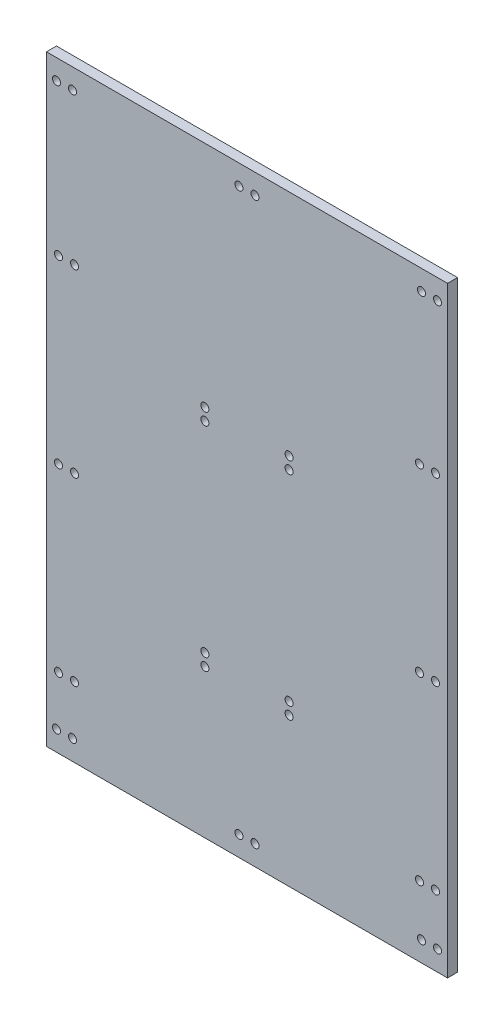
ISO-10303-21;
HEADER;
FILE_DESCRIPTION(('STEP AP214'),'2;1');
FILE_NAME('part.step','',(''),(''),'','','');
FILE_SCHEMA(('AUTOMOTIVE_DESIGN { 1 0 10303 214 1 1 1 1 }'));
ENDSEC;
DATA;
#1=APPLICATION_CONTEXT('core data for automotive mechanical design processes');
#2=APPLICATION_PROTOCOL_DEFINITION('international standard','automotive_design',2000,#1);
#3=PRODUCT_CONTEXT('',#1,'mechanical');
#4=PRODUCT('Part','Part','',(#3));
#5=PRODUCT_RELATED_PRODUCT_CATEGORY('part','',(#4));
#6=PRODUCT_DEFINITION_FORMATION('','',#4);
#7=PRODUCT_DEFINITION_CONTEXT('part definition',#1,'design');
#8=PRODUCT_DEFINITION('design','',#6,#7);
#9=PRODUCT_DEFINITION_SHAPE('','',#8);
#10=(LENGTH_UNIT() NAMED_UNIT(*) SI_UNIT(.MILLI.,.METRE.));
#11=(NAMED_UNIT(*) PLANE_ANGLE_UNIT() SI_UNIT($,.RADIAN.));
#12=(NAMED_UNIT(*) SI_UNIT($,.STERADIAN.) SOLID_ANGLE_UNIT());
#13=UNCERTAINTY_MEASURE_WITH_UNIT(LENGTH_MEASURE(1.E-05),#10,'distance_accuracy_value','');
#14=(GEOMETRIC_REPRESENTATION_CONTEXT(3) GLOBAL_UNCERTAINTY_ASSIGNED_CONTEXT((#13)) GLOBAL_UNIT_ASSIGNED_CONTEXT((#10,
#11,#12)) REPRESENTATION_CONTEXT('',''));
#15=CARTESIAN_POINT('',(0.,0.,0.));
#16=DIRECTION('',(0.,0.,1.));
#17=DIRECTION('',(1.,0.,0.));
#18=AXIS2_PLACEMENT_3D('',#15,#16,#17);
#19=CARTESIAN_POINT('',(100.,-150.,5.));
#20=DIRECTION('',(-1.,0.,0.));
#21=DIRECTION('',(0.,0.,1.));
#22=AXIS2_PLACEMENT_3D('',#19,#20,#21);
#23=PLANE('',#22);
#24=DIRECTION('',(0.,1.,0.));
#25=VECTOR('',#24,1.);
#26=CARTESIAN_POINT('',(100.,-150.,0.));
#27=LINE('',#26,#25);
#28=CARTESIAN_POINT('',(100.,-150.,0.));
#29=VERTEX_POINT('',#28);
#30=CARTESIAN_POINT('',(100.,150.,0.));
#31=VERTEX_POINT('',#30);
#32=EDGE_CURVE('E110',#29,#31,#27,.T.);
#33=ORIENTED_EDGE('',*,*,#32,.T.);
#34=DIRECTION('',(0.,0.,-1.));
#35=VECTOR('',#34,1.);
#36=CARTESIAN_POINT('',(100.,150.,5.));
#37=LINE('',#36,#35);
#38=CARTESIAN_POINT('',(100.,150.,5.));
#39=VERTEX_POINT('',#38);
#40=EDGE_CURVE('E11',#39,#31,#37,.T.);
#41=ORIENTED_EDGE('',*,*,#40,.F.);
#42=DIRECTION('',(0.,1.,0.));
#43=VECTOR('',#42,1.);
#44=CARTESIAN_POINT('',(100.,-150.,5.));
#45=LINE('',#44,#43);
#46=CARTESIAN_POINT('',(100.,-150.,5.));
#47=VERTEX_POINT('',#46);
#48=EDGE_CURVE('E93',#47,#39,#45,.T.);
#49=ORIENTED_EDGE('',*,*,#48,.F.);
#50=DIRECTION('',(0.,0.,-1.));
#51=VECTOR('',#50,1.);
#52=CARTESIAN_POINT('',(100.,-150.,5.));
#53=LINE('',#52,#51);
#54=EDGE_CURVE('E106',#47,#29,#53,.T.);
#55=ORIENTED_EDGE('',*,*,#54,.T.);
#56=EDGE_LOOP('',(#33,#41,#49,#55));
#57=FACE_BOUND('',#56,.T.);
#58=ADVANCED_FACE('F39',(#57),#23,.F.);
#59=CARTESIAN_POINT('',(-100.,150.,5.));
#60=DIRECTION('',(0.,-1.,0.));
#61=DIRECTION('',(0.,0.,-1.));
#62=AXIS2_PLACEMENT_3D('',#59,#60,#61);
#63=PLANE('',#62);
#64=DIRECTION('',(-1.,0.,0.));
#65=VECTOR('',#64,1.);
#66=CARTESIAN_POINT('',(-100.,150.,0.));
#67=LINE('',#66,#65);
#68=CARTESIAN_POINT('',(-100.,150.,0.));
#69=VERTEX_POINT('',#68);
#70=EDGE_CURVE('E98',#31,#69,#67,.T.);
#71=ORIENTED_EDGE('',*,*,#70,.T.);
#72=DIRECTION('',(0.,0.,-1.));
#73=VECTOR('',#72,1.);
#74=CARTESIAN_POINT('',(-100.,150.,5.));
#75=LINE('',#74,#73);
#76=CARTESIAN_POINT('',(-100.,150.,5.));
#77=VERTEX_POINT('',#76);
#78=EDGE_CURVE('E49',#77,#69,#75,.T.);
#79=ORIENTED_EDGE('',*,*,#78,.F.);
#80=DIRECTION('',(-1.,0.,0.));
#81=VECTOR('',#80,1.);
#82=CARTESIAN_POINT('',(-100.,150.,5.));
#83=LINE('',#82,#81);
#84=EDGE_CURVE('E88',#39,#77,#83,.T.);
#85=ORIENTED_EDGE('',*,*,#84,.F.);
#86=ORIENTED_EDGE('',*,*,#40,.T.);
#87=EDGE_LOOP('',(#71,#79,#85,#86));
#88=FACE_BOUND('',#87,.T.);
#89=ADVANCED_FACE('F97',(#88),#63,.F.);
#90=CARTESIAN_POINT('',(-100.,-150.,5.));
#91=DIRECTION('',(1.,0.,0.));
#92=DIRECTION('',(0.,0.,-1.));
#93=AXIS2_PLACEMENT_3D('',#90,#91,#92);
#94=PLANE('',#93);
#95=DIRECTION('',(0.,-1.,0.));
#96=VECTOR('',#95,1.);
#97=CARTESIAN_POINT('',(-100.,-150.,0.));
#98=LINE('',#97,#96);
#99=CARTESIAN_POINT('',(-100.,-150.,0.));
#100=VERTEX_POINT('',#99);
#101=EDGE_CURVE('E75',#69,#100,#98,.T.);
#102=ORIENTED_EDGE('',*,*,#101,.T.);
#103=DIRECTION('',(0.,0.,-1.));
#104=VECTOR('',#103,1.);
#105=CARTESIAN_POINT('',(-100.,-150.,5.));
#106=LINE('',#105,#104);
#107=CARTESIAN_POINT('',(-100.,-150.,5.));
#108=VERTEX_POINT('',#107);
#109=EDGE_CURVE('E100',#108,#100,#106,.T.);
#110=ORIENTED_EDGE('',*,*,#109,.F.);
#111=DIRECTION('',(0.,-1.,0.));
#112=VECTOR('',#111,1.);
#113=CARTESIAN_POINT('',(-100.,-150.,5.));
#114=LINE('',#113,#112);
#115=EDGE_CURVE('E91',#77,#108,#114,.T.);
#116=ORIENTED_EDGE('',*,*,#115,.F.);
#117=ORIENTED_EDGE('',*,*,#78,.T.);
#118=EDGE_LOOP('',(#102,#110,#116,#117));
#119=FACE_BOUND('',#118,.T.);
#120=ADVANCED_FACE('F102',(#119),#94,.F.);
#121=CARTESIAN_POINT('',(-100.,-150.,5.));
#122=DIRECTION('',(0.,1.,0.));
#123=DIRECTION('',(0.,0.,1.));
#124=AXIS2_PLACEMENT_3D('',#121,#122,#123);
#125=PLANE('',#124);
#126=DIRECTION('',(1.,0.,0.));
#127=VECTOR('',#126,1.);
#128=CARTESIAN_POINT('',(-100.,-150.,0.));
#129=LINE('',#128,#127);
#130=EDGE_CURVE('E81',#100,#29,#129,.T.);
#131=ORIENTED_EDGE('',*,*,#130,.T.);
#132=ORIENTED_EDGE('',*,*,#54,.F.);
#133=DIRECTION('',(1.,0.,0.));
#134=VECTOR('',#133,1.);
#135=CARTESIAN_POINT('',(-100.,-150.,5.));
#136=LINE('',#135,#134);
#137=EDGE_CURVE('E58',#108,#47,#136,.T.);
#138=ORIENTED_EDGE('',*,*,#137,.F.);
#139=ORIENTED_EDGE('',*,*,#109,.T.);
#140=EDGE_LOOP('',(#131,#132,#138,#139));
#141=FACE_BOUND('',#140,.T.);
#142=ADVANCED_FACE('F392',(#141),#125,.F.);
#143=CARTESIAN_POINT('',(0.,0.,5.));
#144=DIRECTION('',(0.,0.,-1.));
#145=DIRECTION('',(-1.,0.,0.));
#146=AXIS2_PLACEMENT_3D('',#143,#144,#145);
#147=PLANE('',#146);
#148=CARTESIAN_POINT('',(87.,140.,5.));
#149=DIRECTION('',(0.,0.,1.));
#150=DIRECTION('',(-1.,0.,0.));
#151=AXIS2_PLACEMENT_3D('',#148,#149,#150);
#152=CIRCLE('',#151,2.);
#153=CARTESIAN_POINT('',(89.,140.,4.99999999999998));
#154=VERTEX_POINT('',#153);
#155=EDGE_CURVE('E348',#154,#154,#152,.T.);
#156=ORIENTED_EDGE('',*,*,#155,.F.);
#157=EDGE_LOOP('',(#156));
#158=FACE_BOUND('',#157,.T.);
#159=CARTESIAN_POINT('',(87.0000000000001,-140.,5.));
#160=DIRECTION('',(0.,0.,1.));
#161=DIRECTION('',(1.,0.,0.));
#162=AXIS2_PLACEMENT_3D('',#159,#160,#161);
#163=CIRCLE('',#162,2.);
#164=CARTESIAN_POINT('',(89.0000000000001,-140.,4.99999999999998));
#165=VERTEX_POINT('',#164);
#166=EDGE_CURVE('E359',#165,#165,#163,.T.);
#167=ORIENTED_EDGE('',*,*,#166,.F.);
#168=EDGE_LOOP('',(#167));
#169=FACE_BOUND('',#168,.T.);
#170=CARTESIAN_POINT('',(95.0000000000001,-140.,5.));
#171=DIRECTION('',(0.,0.,1.));
#172=DIRECTION('',(1.,0.,0.));
#173=AXIS2_PLACEMENT_3D('',#170,#171,#172);
#174=CIRCLE('',#173,2.);
#175=CARTESIAN_POINT('',(97.0000000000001,-140.,4.99999999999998));
#176=VERTEX_POINT('',#175);
#177=EDGE_CURVE('E363',#176,#176,#174,.T.);
#178=ORIENTED_EDGE('',*,*,#177,.F.);
#179=EDGE_LOOP('',(#178));
#180=FACE_BOUND('',#179,.T.);
#181=CARTESIAN_POINT('',(4.00000000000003,-140.,5.));
#182=DIRECTION('',(0.,0.,1.));
#183=DIRECTION('',(1.,0.,0.));
#184=AXIS2_PLACEMENT_3D('',#181,#182,#183);
#185=CIRCLE('',#184,2.);
#186=CARTESIAN_POINT('',(6.00000000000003,-140.,4.99999999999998));
#187=VERTEX_POINT('',#186);
#188=EDGE_CURVE('E367',#187,#187,#185,.T.);
#189=ORIENTED_EDGE('',*,*,#188,.F.);
#190=EDGE_LOOP('',(#189));
#191=FACE_BOUND('',#190,.T.);
#192=CARTESIAN_POINT('',(95.,140.,5.));
#193=DIRECTION('',(0.,0.,1.));
#194=DIRECTION('',(-1.,0.,0.));
#195=AXIS2_PLACEMENT_3D('',#192,#193,#194);
#196=CIRCLE('',#195,2.);
#197=CARTESIAN_POINT('',(97.,140.,4.99999999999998));
#198=VERTEX_POINT('',#197);
#199=EDGE_CURVE('E343',#198,#198,#196,.T.);
#200=ORIENTED_EDGE('',*,*,#199,.F.);
#201=EDGE_LOOP('',(#200));
#202=FACE_BOUND('',#201,.T.);
#203=CARTESIAN_POINT('',(4.,140.,5.));
#204=DIRECTION('',(0.,0.,1.));
#205=DIRECTION('',(-1.,0.,0.));
#206=AXIS2_PLACEMENT_3D('',#203,#204,#205);
#207=CIRCLE('',#206,2.);
#208=CARTESIAN_POINT('',(6.,140.,4.99999999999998));
#209=VERTEX_POINT('',#208);
#210=EDGE_CURVE('E347',#209,#209,#207,.T.);
#211=ORIENTED_EDGE('',*,*,#210,.F.);
#212=EDGE_LOOP('',(#211));
#213=FACE_BOUND('',#212,.T.);
#214=CARTESIAN_POINT('',(-4.,140.,5.));
#215=DIRECTION('',(0.,0.,1.));
#216=DIRECTION('',(1.,0.,0.));
#217=AXIS2_PLACEMENT_3D('',#214,#215,#216);
#218=CIRCLE('',#217,2.);
#219=CARTESIAN_POINT('',(-2.,140.,4.99999999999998));
#220=VERTEX_POINT('',#219);
#221=EDGE_CURVE('E352',#220,#220,#218,.T.);
#222=ORIENTED_EDGE('',*,*,#221,.F.);
#223=EDGE_LOOP('',(#222));
#224=FACE_BOUND('',#223,.T.);
#225=CARTESIAN_POINT('',(-87.,140.,5.));
#226=DIRECTION('',(0.,0.,1.));
#227=DIRECTION('',(1.,0.,0.));
#228=AXIS2_PLACEMENT_3D('',#225,#226,#227);
#229=CIRCLE('',#228,2.);
#230=CARTESIAN_POINT('',(-85.,140.,4.99999999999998));
#231=VERTEX_POINT('',#230);
#232=EDGE_CURVE('E342',#231,#231,#229,.T.);
#233=ORIENTED_EDGE('',*,*,#232,.F.);
#234=EDGE_LOOP('',(#233));
#235=FACE_BOUND('',#234,.T.);
#236=CARTESIAN_POINT('',(-3.99999999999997,-140.,5.));
#237=DIRECTION('',(0.,0.,1.));
#238=DIRECTION('',(-1.,0.,0.));
#239=AXIS2_PLACEMENT_3D('',#236,#237,#238);
#240=CIRCLE('',#239,2.);
#241=CARTESIAN_POINT('',(-1.99999999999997,-140.,4.99999999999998));
#242=VERTEX_POINT('',#241);
#243=EDGE_CURVE('E371',#242,#242,#240,.T.);
#244=ORIENTED_EDGE('',*,*,#243,.F.);
#245=EDGE_LOOP('',(#244));
#246=FACE_BOUND('',#245,.T.);
#247=CARTESIAN_POINT('',(-87.,-140.,5.));
#248=DIRECTION('',(0.,0.,1.));
#249=DIRECTION('',(-1.,0.,0.));
#250=AXIS2_PLACEMENT_3D('',#247,#248,#249);
#251=CIRCLE('',#250,2.);
#252=CARTESIAN_POINT('',(-85.,-140.,4.99999999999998));
#253=VERTEX_POINT('',#252);
#254=EDGE_CURVE('E379',#253,#253,#251,.T.);
#255=ORIENTED_EDGE('',*,*,#254,.F.);
#256=EDGE_LOOP('',(#255));
#257=FACE_BOUND('',#256,.T.);
#258=CARTESIAN_POINT('',(-95.,-140.,5.));
#259=DIRECTION('',(0.,0.,1.));
#260=DIRECTION('',(-1.,0.,0.));
#261=AXIS2_PLACEMENT_3D('',#258,#259,#260);
#262=CIRCLE('',#261,2.);
#263=CARTESIAN_POINT('',(-93.,-140.,4.99999999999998));
#264=VERTEX_POINT('',#263);
#265=EDGE_CURVE('E375',#264,#264,#262,.T.);
#266=ORIENTED_EDGE('',*,*,#265,.F.);
#267=EDGE_LOOP('',(#266));
#268=FACE_BOUND('',#267,.T.);
#269=CARTESIAN_POINT('',(-95.,140.,5.));
#270=DIRECTION('',(0.,0.,1.));
#271=DIRECTION('',(1.,0.,0.));
#272=AXIS2_PLACEMENT_3D('',#269,#270,#271);
#273=CIRCLE('',#272,2.);
#274=CARTESIAN_POINT('',(-93.,140.,4.99999999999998));
#275=VERTEX_POINT('',#274);
#276=EDGE_CURVE('E130',#275,#275,#273,.T.);
#277=ORIENTED_EDGE('',*,*,#276,.F.);
#278=EDGE_LOOP('',(#277));
#279=FACE_BOUND('',#278,.T.);
#280=CARTESIAN_POINT('',(-21.,36.,5.));
#281=DIRECTION('',(0.,0.,1.));
#282=DIRECTION('',(1.,0.,0.));
#283=AXIS2_PLACEMENT_3D('',#280,#281,#282);
#284=CIRCLE('',#283,2.00000000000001);
#285=CARTESIAN_POINT('',(-19.,36.,5.));
#286=VERTEX_POINT('',#285);
#287=EDGE_CURVE('E192',#286,#286,#284,.T.);
#288=ORIENTED_EDGE('',*,*,#287,.F.);
#289=EDGE_LOOP('',(#288));
#290=FACE_BOUND('',#289,.T.);
#291=CARTESIAN_POINT('',(21.,36.,5.));
#292=DIRECTION('',(0.,0.,1.));
#293=DIRECTION('',(-1.,0.,0.));
#294=AXIS2_PLACEMENT_3D('',#291,#292,#293);
#295=CIRCLE('',#294,2.00000000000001);
#296=CARTESIAN_POINT('',(19.,36.,5.));
#297=VERTEX_POINT('',#296);
#298=EDGE_CURVE('E200',#297,#297,#295,.T.);
#299=ORIENTED_EDGE('',*,*,#298,.F.);
#300=EDGE_LOOP('',(#299));
#301=FACE_BOUND('',#300,.T.);
#302=CARTESIAN_POINT('',(21.,30.,5.));
#303=DIRECTION('',(0.,0.,1.));
#304=DIRECTION('',(-1.,0.,0.));
#305=AXIS2_PLACEMENT_3D('',#302,#303,#304);
#306=CIRCLE('',#305,2.00000000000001);
#307=CARTESIAN_POINT('',(19.,30.,5.));
#308=VERTEX_POINT('',#307);
#309=EDGE_CURVE('E208',#308,#308,#306,.T.);
#310=ORIENTED_EDGE('',*,*,#309,.F.);
#311=EDGE_LOOP('',(#310));
#312=FACE_BOUND('',#311,.T.);
#313=CARTESIAN_POINT('',(21.,-70.,5.));
#314=DIRECTION('',(0.,0.,1.));
#315=DIRECTION('',(1.,0.,0.));
#316=AXIS2_PLACEMENT_3D('',#313,#314,#315);
#317=CIRCLE('',#316,2.00000000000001);
#318=CARTESIAN_POINT('',(23.,-70.,5.));
#319=VERTEX_POINT('',#318);
#320=EDGE_CURVE('E216',#319,#319,#317,.T.);
#321=ORIENTED_EDGE('',*,*,#320,.F.);
#322=EDGE_LOOP('',(#321));
#323=FACE_BOUND('',#322,.T.);
#324=CARTESIAN_POINT('',(21.,-76.,5.));
#325=DIRECTION('',(0.,0.,1.));
#326=DIRECTION('',(1.,0.,0.));
#327=AXIS2_PLACEMENT_3D('',#324,#325,#326);
#328=CIRCLE('',#327,2.00000000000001);
#329=CARTESIAN_POINT('',(23.,-76.,5.));
#330=VERTEX_POINT('',#329);
#331=EDGE_CURVE('E326',#330,#330,#328,.T.);
#332=ORIENTED_EDGE('',*,*,#331,.F.);
#333=EDGE_LOOP('',(#332));
#334=FACE_BOUND('',#333,.T.);
#335=CARTESIAN_POINT('',(-21.,-76.,5.));
#336=DIRECTION('',(0.,0.,1.));
#337=DIRECTION('',(-1.,0.,0.));
#338=AXIS2_PLACEMENT_3D('',#335,#336,#337);
#339=CIRCLE('',#338,2.00000000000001);
#340=CARTESIAN_POINT('',(-23.,-76.,5.));
#341=VERTEX_POINT('',#340);
#342=EDGE_CURVE('E183',#341,#341,#339,.T.);
#343=ORIENTED_EDGE('',*,*,#342,.F.);
#344=EDGE_LOOP('',(#343));
#345=FACE_BOUND('',#344,.T.);
#346=CARTESIAN_POINT('',(-21.,-70.,5.));
#347=DIRECTION('',(0.,0.,1.));
#348=DIRECTION('',(-1.,0.,0.));
#349=AXIS2_PLACEMENT_3D('',#346,#347,#348);
#350=CIRCLE('',#349,2.);
#351=CARTESIAN_POINT('',(-23.,-70.,5.));
#352=VERTEX_POINT('',#351);
#353=EDGE_CURVE('E172',#352,#352,#350,.T.);
#354=ORIENTED_EDGE('',*,*,#353,.F.);
#355=EDGE_LOOP('',(#354));
#356=FACE_BOUND('',#355,.T.);
#357=CARTESIAN_POINT('',(-21.,30.,5.));
#358=DIRECTION('',(0.,0.,1.));
#359=DIRECTION('',(1.,0.,0.));
#360=AXIS2_PLACEMENT_3D('',#357,#358,#359);
#361=CIRCLE('',#360,2.);
#362=CARTESIAN_POINT('',(-19.,30.,5.));
#363=VERTEX_POINT('',#362);
#364=EDGE_CURVE('E191',#363,#363,#361,.T.);
#365=ORIENTED_EDGE('',*,*,#364,.F.);
#366=EDGE_LOOP('',(#365));
#367=FACE_BOUND('',#366,.T.);
#368=CARTESIAN_POINT('',(86.,65.0000000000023,5.));
#369=DIRECTION('',(0.,0.,1.));
#370=DIRECTION('',(1.,0.,0.));
#371=AXIS2_PLACEMENT_3D('',#368,#369,#370);
#372=CIRCLE('',#371,2.00000000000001);
#373=CARTESIAN_POINT('',(88.,65.0000000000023,5.));
#374=VERTEX_POINT('',#373);
#375=EDGE_CURVE('E274',#374,#374,#372,.T.);
#376=ORIENTED_EDGE('',*,*,#375,.F.);
#377=EDGE_LOOP('',(#376));
#378=FACE_BOUND('',#377,.T.);
#379=CARTESIAN_POINT('',(-94.,64.9999999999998,5.));
#380=DIRECTION('',(0.,0.,1.));
#381=DIRECTION('',(-1.,0.,0.));
#382=AXIS2_PLACEMENT_3D('',#379,#380,#381);
#383=CIRCLE('',#382,2.);
#384=CARTESIAN_POINT('',(-96.,64.9999999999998,5.));
#385=VERTEX_POINT('',#384);
#386=EDGE_CURVE('E257',#385,#385,#383,.T.);
#387=ORIENTED_EDGE('',*,*,#386,.F.);
#388=EDGE_LOOP('',(#387));
#389=FACE_BOUND('',#388,.T.);
#390=CARTESIAN_POINT('',(-86.,65.0000000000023,5.));
#391=DIRECTION('',(0.,0.,1.));
#392=DIRECTION('',(-1.,0.,0.));
#393=AXIS2_PLACEMENT_3D('',#390,#391,#392);
#394=CIRCLE('',#393,2.00000000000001);
#395=CARTESIAN_POINT('',(-88.,65.0000000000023,5.));
#396=VERTEX_POINT('',#395);
#397=EDGE_CURVE('E258',#396,#396,#394,.T.);
#398=ORIENTED_EDGE('',*,*,#397,.F.);
#399=EDGE_LOOP('',(#398));
#400=FACE_BOUND('',#399,.T.);
#401=CARTESIAN_POINT('',(-85.9999999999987,-115.000000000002,5.));
#402=DIRECTION('',(0.,0.,1.));
#403=DIRECTION('',(1.,0.,0.));
#404=AXIS2_PLACEMENT_3D('',#401,#402,#403);
#405=CIRCLE('',#404,2.00000000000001);
#406=CARTESIAN_POINT('',(-83.9999999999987,-115.000000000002,5.));
#407=VERTEX_POINT('',#406);
#408=EDGE_CURVE('E233',#407,#407,#405,.T.);
#409=ORIENTED_EDGE('',*,*,#408,.F.);
#410=EDGE_LOOP('',(#409));
#411=FACE_BOUND('',#410,.T.);
#412=CARTESIAN_POINT('',(93.9999999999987,65.0000000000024,5.));
#413=DIRECTION('',(0.,0.,1.));
#414=DIRECTION('',(1.,0.,0.));
#415=AXIS2_PLACEMENT_3D('',#412,#413,#414);
#416=CIRCLE('',#415,2.);
#417=CARTESIAN_POINT('',(95.9999999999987,65.0000000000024,5.));
#418=VERTEX_POINT('',#417);
#419=EDGE_CURVE('E273',#418,#418,#416,.T.);
#420=ORIENTED_EDGE('',*,*,#419,.F.);
#421=EDGE_LOOP('',(#420));
#422=FACE_BOUND('',#421,.T.);
#423=CARTESIAN_POINT('',(93.9999999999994,-24.9999999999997,5.));
#424=DIRECTION('',(0.,0.,1.));
#425=DIRECTION('',(-1.,0.,0.));
#426=AXIS2_PLACEMENT_3D('',#423,#424,#425);
#427=CIRCLE('',#426,2.);
#428=CARTESIAN_POINT('',(91.9999999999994,-24.9999999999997,5.));
#429=VERTEX_POINT('',#428);
#430=EDGE_CURVE('E306',#429,#429,#427,.T.);
#431=ORIENTED_EDGE('',*,*,#430,.F.);
#432=EDGE_LOOP('',(#431));
#433=FACE_BOUND('',#432,.T.);
#434=CARTESIAN_POINT('',(-93.9999999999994,-24.9999999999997,5.));
#435=DIRECTION('',(0.,0.,1.));
#436=DIRECTION('',(1.,0.,0.));
#437=AXIS2_PLACEMENT_3D('',#434,#435,#436);
#438=CIRCLE('',#437,2.);
#439=CARTESIAN_POINT('',(-91.9999999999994,-24.9999999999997,5.));
#440=VERTEX_POINT('',#439);
#441=EDGE_CURVE('E298',#440,#440,#438,.T.);
#442=ORIENTED_EDGE('',*,*,#441,.F.);
#443=EDGE_LOOP('',(#442));
#444=FACE_BOUND('',#443,.T.);
#445=CARTESIAN_POINT('',(-86.0000000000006,-24.9999999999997,5.));
#446=DIRECTION('',(0.,0.,1.));
#447=DIRECTION('',(1.,0.,0.));
#448=AXIS2_PLACEMENT_3D('',#445,#446,#447);
#449=CIRCLE('',#448,2.00000000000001);
#450=CARTESIAN_POINT('',(-84.0000000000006,-24.9999999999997,5.));
#451=VERTEX_POINT('',#450);
#452=EDGE_CURVE('E290',#451,#451,#449,.T.);
#453=ORIENTED_EDGE('',*,*,#452,.F.);
#454=EDGE_LOOP('',(#453));
#455=FACE_BOUND('',#454,.T.);
#456=CARTESIAN_POINT('',(-93.9999999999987,-115.,5.));
#457=DIRECTION('',(0.,0.,1.));
#458=DIRECTION('',(1.,0.,0.));
#459=AXIS2_PLACEMENT_3D('',#456,#457,#458);
#460=CIRCLE('',#459,2.);
#461=CARTESIAN_POINT('',(-91.9999999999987,-115.,5.));
#462=VERTEX_POINT('',#461);
#463=EDGE_CURVE('E234',#462,#462,#460,.T.);
#464=ORIENTED_EDGE('',*,*,#463,.F.);
#465=EDGE_LOOP('',(#464));
#466=FACE_BOUND('',#465,.T.);
#467=CARTESIAN_POINT('',(86.0000000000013,-115.,5.));
#468=DIRECTION('',(0.,0.,1.));
#469=DIRECTION('',(-1.,0.,0.));
#470=AXIS2_PLACEMENT_3D('',#467,#468,#469);
#471=CIRCLE('',#470,2.00000000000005);
#472=CARTESIAN_POINT('',(84.0000000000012,-115.,5.));
#473=VERTEX_POINT('',#472);
#474=EDGE_CURVE('E242',#473,#473,#471,.T.);
#475=ORIENTED_EDGE('',*,*,#474,.F.);
#476=EDGE_LOOP('',(#475));
#477=FACE_BOUND('',#476,.T.);
#478=CARTESIAN_POINT('',(94.,-115.,5.));
#479=DIRECTION('',(0.,0.,1.));
#480=DIRECTION('',(-1.,0.,0.));
#481=AXIS2_PLACEMENT_3D('',#478,#479,#480);
#482=CIRCLE('',#481,2.00000000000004);
#483=CARTESIAN_POINT('',(92.,-115.,5.));
#484=VERTEX_POINT('',#483);
#485=EDGE_CURVE('E225',#484,#484,#482,.T.);
#486=ORIENTED_EDGE('',*,*,#485,.F.);
#487=EDGE_LOOP('',(#486));
#488=FACE_BOUND('',#487,.T.);
#489=CARTESIAN_POINT('',(86.0000000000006,-24.9999999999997,5.));
#490=DIRECTION('',(0.,0.,1.));
#491=DIRECTION('',(-1.,0.,0.));
#492=AXIS2_PLACEMENT_3D('',#489,#490,#491);
#493=CIRCLE('',#492,2.00000000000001);
#494=CARTESIAN_POINT('',(84.0000000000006,-24.9999999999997,5.));
#495=VERTEX_POINT('',#494);
#496=EDGE_CURVE('E289',#495,#495,#493,.T.);
#497=ORIENTED_EDGE('',*,*,#496,.F.);
#498=EDGE_LOOP('',(#497));
#499=FACE_BOUND('',#498,.T.);
#500=ORIENTED_EDGE('',*,*,#48,.T.);
#501=ORIENTED_EDGE('',*,*,#84,.T.);
#502=ORIENTED_EDGE('',*,*,#115,.T.);
#503=ORIENTED_EDGE('',*,*,#137,.T.);
#504=EDGE_LOOP('',(#500,#501,#502,#503));
#505=FACE_BOUND('',#504,.T.);
#506=ADVANCED_FACE('F89',(#158,#169,#180,#191,#202,#213,#224,#235,#246,#257,#268,#279,#290,#301,
#312,#323,#334,#345,#356,#367,#378,#389,#400,#411,#422,#433,#444,#455,#466,#477,#488,#499,#505),
#147,.F.);
#507=CARTESIAN_POINT('',(0.,0.,0.));
#508=DIRECTION('',(0.,0.,-1.));
#509=DIRECTION('',(-1.,0.,0.));
#510=AXIS2_PLACEMENT_3D('',#507,#508,#509);
#511=PLANE('',#510);
#512=CARTESIAN_POINT('',(87.,140.,0.));
#513=DIRECTION('',(0.,0.,-1.));
#514=DIRECTION('',(-1.,0.,0.));
#515=AXIS2_PLACEMENT_3D('',#512,#513,#514);
#516=CIRCLE('',#515,2.);
#517=CARTESIAN_POINT('',(89.,140.,0.));
#518=VERTEX_POINT('',#517);
#519=EDGE_CURVE('E42',#518,#518,#516,.T.);
#520=ORIENTED_EDGE('',*,*,#519,.F.);
#521=EDGE_LOOP('',(#520));
#522=FACE_BOUND('',#521,.T.);
#523=CARTESIAN_POINT('',(87.0000000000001,-140.,0.));
#524=DIRECTION('',(0.,0.,-1.));
#525=DIRECTION('',(-1.,0.,0.));
#526=AXIS2_PLACEMENT_3D('',#523,#524,#525);
#527=CIRCLE('',#526,2.);
#528=CARTESIAN_POINT('',(89.0000000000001,-140.,0.));
#529=VERTEX_POINT('',#528);
#530=EDGE_CURVE('E165',#529,#529,#527,.T.);
#531=ORIENTED_EDGE('',*,*,#530,.F.);
#532=EDGE_LOOP('',(#531));
#533=FACE_BOUND('',#532,.T.);
#534=CARTESIAN_POINT('',(95.0000000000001,-140.,0.));
#535=DIRECTION('',(0.,0.,-1.));
#536=DIRECTION('',(-1.,0.,0.));
#537=AXIS2_PLACEMENT_3D('',#534,#535,#536);
#538=CIRCLE('',#537,2.);
#539=CARTESIAN_POINT('',(97.0000000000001,-140.,0.));
#540=VERTEX_POINT('',#539);
#541=EDGE_CURVE('E162',#540,#540,#538,.T.);
#542=ORIENTED_EDGE('',*,*,#541,.F.);
#543=EDGE_LOOP('',(#542));
#544=FACE_BOUND('',#543,.T.);
#545=CARTESIAN_POINT('',(4.00000000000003,-140.,0.));
#546=DIRECTION('',(0.,0.,-1.));
#547=DIRECTION('',(-1.,0.,0.));
#548=AXIS2_PLACEMENT_3D('',#545,#546,#547);
#549=CIRCLE('',#548,2.);
#550=CARTESIAN_POINT('',(6.00000000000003,-140.,0.));
#551=VERTEX_POINT('',#550);
#552=EDGE_CURVE('E158',#551,#551,#549,.T.);
#553=ORIENTED_EDGE('',*,*,#552,.F.);
#554=EDGE_LOOP('',(#553));
#555=FACE_BOUND('',#554,.T.);
#556=CARTESIAN_POINT('',(95.,140.,0.));
#557=DIRECTION('',(0.,0.,-1.));
#558=DIRECTION('',(-1.,0.,0.));
#559=AXIS2_PLACEMENT_3D('',#556,#557,#558);
#560=CIRCLE('',#559,2.);
#561=CARTESIAN_POINT('',(97.,140.,0.));
#562=VERTEX_POINT('',#561);
#563=EDGE_CURVE('E154',#562,#562,#560,.T.);
#564=ORIENTED_EDGE('',*,*,#563,.F.);
#565=EDGE_LOOP('',(#564));
#566=FACE_BOUND('',#565,.T.);
#567=CARTESIAN_POINT('',(4.,140.,0.));
#568=DIRECTION('',(0.,0.,-1.));
#569=DIRECTION('',(-1.,0.,0.));
#570=AXIS2_PLACEMENT_3D('',#567,#568,#569);
#571=CIRCLE('',#570,2.);
#572=CARTESIAN_POINT('',(6.,140.,0.));
#573=VERTEX_POINT('',#572);
#574=EDGE_CURVE('E150',#573,#573,#571,.T.);
#575=ORIENTED_EDGE('',*,*,#574,.F.);
#576=EDGE_LOOP('',(#575));
#577=FACE_BOUND('',#576,.T.);
#578=CARTESIAN_POINT('',(-4.,140.,0.));
#579=DIRECTION('',(0.,0.,-1.));
#580=DIRECTION('',(-1.,0.,0.));
#581=AXIS2_PLACEMENT_3D('',#578,#579,#580);
#582=CIRCLE('',#581,2.);
#583=CARTESIAN_POINT('',(-2.,140.,0.));
#584=VERTEX_POINT('',#583);
#585=EDGE_CURVE('E146',#584,#584,#582,.T.);
#586=ORIENTED_EDGE('',*,*,#585,.F.);
#587=EDGE_LOOP('',(#586));
#588=FACE_BOUND('',#587,.T.);
#589=CARTESIAN_POINT('',(-87.,140.,0.));
#590=DIRECTION('',(0.,0.,-1.));
#591=DIRECTION('',(-1.,0.,0.));
#592=AXIS2_PLACEMENT_3D('',#589,#590,#591);
#593=CIRCLE('',#592,2.);
#594=CARTESIAN_POINT('',(-85.,140.,0.));
#595=VERTEX_POINT('',#594);
#596=EDGE_CURVE('E142',#595,#595,#593,.T.);
#597=ORIENTED_EDGE('',*,*,#596,.F.);
#598=EDGE_LOOP('',(#597));
#599=FACE_BOUND('',#598,.T.);
#600=CARTESIAN_POINT('',(-3.99999999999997,-140.,0.));
#601=DIRECTION('',(0.,0.,-1.));
#602=DIRECTION('',(-1.,0.,0.));
#603=AXIS2_PLACEMENT_3D('',#600,#601,#602);
#604=CIRCLE('',#603,2.);
#605=CARTESIAN_POINT('',(-1.99999999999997,-140.,0.));
#606=VERTEX_POINT('',#605);
#607=EDGE_CURVE('E138',#606,#606,#604,.T.);
#608=ORIENTED_EDGE('',*,*,#607,.F.);
#609=EDGE_LOOP('',(#608));
#610=FACE_BOUND('',#609,.T.);
#611=CARTESIAN_POINT('',(-87.,-140.,0.));
#612=DIRECTION('',(0.,0.,-1.));
#613=DIRECTION('',(-1.,0.,0.));
#614=AXIS2_PLACEMENT_3D('',#611,#612,#613);
#615=CIRCLE('',#614,2.);
#616=CARTESIAN_POINT('',(-85.,-140.,0.));
#617=VERTEX_POINT('',#616);
#618=EDGE_CURVE('E134',#617,#617,#615,.T.);
#619=ORIENTED_EDGE('',*,*,#618,.F.);
#620=EDGE_LOOP('',(#619));
#621=FACE_BOUND('',#620,.T.);
#622=CARTESIAN_POINT('',(-95.,-140.,0.));
#623=DIRECTION('',(0.,0.,-1.));
#624=DIRECTION('',(-1.,0.,0.));
#625=AXIS2_PLACEMENT_3D('',#622,#623,#624);
#626=CIRCLE('',#625,2.);
#627=CARTESIAN_POINT('',(-93.,-140.,0.));
#628=VERTEX_POINT('',#627);
#629=EDGE_CURVE('E129',#628,#628,#626,.T.);
#630=ORIENTED_EDGE('',*,*,#629,.F.);
#631=EDGE_LOOP('',(#630));
#632=FACE_BOUND('',#631,.T.);
#633=CARTESIAN_POINT('',(-95.,140.,0.));
#634=DIRECTION('',(0.,0.,-1.));
#635=DIRECTION('',(-1.,0.,0.));
#636=AXIS2_PLACEMENT_3D('',#633,#634,#635);
#637=CIRCLE('',#636,2.);
#638=CARTESIAN_POINT('',(-93.,140.,0.));
#639=VERTEX_POINT('',#638);
#640=EDGE_CURVE('E125',#639,#639,#637,.T.);
#641=ORIENTED_EDGE('',*,*,#640,.F.);
#642=EDGE_LOOP('',(#641));
#643=FACE_BOUND('',#642,.T.);
#644=CARTESIAN_POINT('',(-21.,36.,0.));
#645=DIRECTION('',(0.,0.,1.));
#646=DIRECTION('',(1.,0.,0.));
#647=AXIS2_PLACEMENT_3D('',#644,#645,#646);
#648=CIRCLE('',#647,2.00000000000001);
#649=CARTESIAN_POINT('',(-19.,36.,0.));
#650=VERTEX_POINT('',#649);
#651=EDGE_CURVE('E187',#650,#650,#648,.T.);
#652=ORIENTED_EDGE('',*,*,#651,.T.);
#653=EDGE_LOOP('',(#652));
#654=FACE_BOUND('',#653,.T.);
#655=CARTESIAN_POINT('',(21.,36.,0.));
#656=DIRECTION('',(0.,0.,1.));
#657=DIRECTION('',(-1.,0.,0.));
#658=AXIS2_PLACEMENT_3D('',#655,#656,#657);
#659=CIRCLE('',#658,2.00000000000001);
#660=CARTESIAN_POINT('',(19.,36.,0.));
#661=VERTEX_POINT('',#660);
#662=EDGE_CURVE('E196',#661,#661,#659,.T.);
#663=ORIENTED_EDGE('',*,*,#662,.T.);
#664=EDGE_LOOP('',(#663));
#665=FACE_BOUND('',#664,.T.);
#666=CARTESIAN_POINT('',(21.,30.,0.));
#667=DIRECTION('',(0.,0.,1.));
#668=DIRECTION('',(-1.,0.,0.));
#669=AXIS2_PLACEMENT_3D('',#666,#667,#668);
#670=CIRCLE('',#669,2.00000000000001);
#671=CARTESIAN_POINT('',(19.,30.,0.));
#672=VERTEX_POINT('',#671);
#673=EDGE_CURVE('E204',#672,#672,#670,.T.);
#674=ORIENTED_EDGE('',*,*,#673,.T.);
#675=EDGE_LOOP('',(#674));
#676=FACE_BOUND('',#675,.T.);
#677=CARTESIAN_POINT('',(21.,-70.,0.));
#678=DIRECTION('',(0.,0.,1.));
#679=DIRECTION('',(1.,0.,0.));
#680=AXIS2_PLACEMENT_3D('',#677,#678,#679);
#681=CIRCLE('',#680,2.00000000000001);
#682=CARTESIAN_POINT('',(23.,-70.,0.));
#683=VERTEX_POINT('',#682);
#684=EDGE_CURVE('E212',#683,#683,#681,.T.);
#685=ORIENTED_EDGE('',*,*,#684,.T.);
#686=EDGE_LOOP('',(#685));
#687=FACE_BOUND('',#686,.T.);
#688=CARTESIAN_POINT('',(21.,-76.,0.));
#689=DIRECTION('',(0.,0.,1.));
#690=DIRECTION('',(1.,0.,0.));
#691=AXIS2_PLACEMENT_3D('',#688,#689,#690);
#692=CIRCLE('',#691,2.00000000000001);
#693=CARTESIAN_POINT('',(23.,-76.,0.));
#694=VERTEX_POINT('',#693);
#695=EDGE_CURVE('E220',#694,#694,#692,.T.);
#696=ORIENTED_EDGE('',*,*,#695,.T.);
#697=EDGE_LOOP('',(#696));
#698=FACE_BOUND('',#697,.T.);
#699=CARTESIAN_POINT('',(-21.,-76.,0.));
#700=DIRECTION('',(0.,0.,1.));
#701=DIRECTION('',(-1.,0.,0.));
#702=AXIS2_PLACEMENT_3D('',#699,#700,#701);
#703=CIRCLE('',#702,2.00000000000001);
#704=CARTESIAN_POINT('',(-23.,-76.,0.));
#705=VERTEX_POINT('',#704);
#706=EDGE_CURVE('E330',#705,#705,#703,.T.);
#707=ORIENTED_EDGE('',*,*,#706,.T.);
#708=EDGE_LOOP('',(#707));
#709=FACE_BOUND('',#708,.T.);
#710=CARTESIAN_POINT('',(-21.,-70.,0.));
#711=DIRECTION('',(0.,0.,1.));
#712=DIRECTION('',(-1.,0.,0.));
#713=AXIS2_PLACEMENT_3D('',#710,#711,#712);
#714=CIRCLE('',#713,2.);
#715=CARTESIAN_POINT('',(-23.,-70.,0.));
#716=VERTEX_POINT('',#715);
#717=EDGE_CURVE('E177',#716,#716,#714,.T.);
#718=ORIENTED_EDGE('',*,*,#717,.T.);
#719=EDGE_LOOP('',(#718));
#720=FACE_BOUND('',#719,.T.);
#721=CARTESIAN_POINT('',(-21.,30.,0.));
#722=DIRECTION('',(0.,0.,1.));
#723=DIRECTION('',(1.,0.,0.));
#724=AXIS2_PLACEMENT_3D('',#721,#722,#723);
#725=CIRCLE('',#724,2.);
#726=CARTESIAN_POINT('',(-19.,30.,0.));
#727=VERTEX_POINT('',#726);
#728=EDGE_CURVE('E221',#727,#727,#725,.T.);
#729=ORIENTED_EDGE('',*,*,#728,.T.);
#730=EDGE_LOOP('',(#729));
#731=FACE_BOUND('',#730,.T.);
#732=CARTESIAN_POINT('',(86.,65.0000000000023,0.));
#733=DIRECTION('',(0.,0.,1.));
#734=DIRECTION('',(1.,0.,0.));
#735=AXIS2_PLACEMENT_3D('',#732,#733,#734);
#736=CIRCLE('',#735,2.00000000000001);
#737=CARTESIAN_POINT('',(88.,65.0000000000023,0.));
#738=VERTEX_POINT('',#737);
#739=EDGE_CURVE('E269',#738,#738,#736,.T.);
#740=ORIENTED_EDGE('',*,*,#739,.T.);
#741=EDGE_LOOP('',(#740));
#742=FACE_BOUND('',#741,.T.);
#743=CARTESIAN_POINT('',(-94.,64.9999999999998,0.));
#744=DIRECTION('',(0.,0.,1.));
#745=DIRECTION('',(-1.,0.,0.));
#746=AXIS2_PLACEMENT_3D('',#743,#744,#745);
#747=CIRCLE('',#746,2.);
#748=CARTESIAN_POINT('',(-96.,64.9999999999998,0.));
#749=VERTEX_POINT('',#748);
#750=EDGE_CURVE('E278',#749,#749,#747,.T.);
#751=ORIENTED_EDGE('',*,*,#750,.T.);
#752=EDGE_LOOP('',(#751));
#753=FACE_BOUND('',#752,.T.);
#754=CARTESIAN_POINT('',(-86.,65.0000000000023,0.));
#755=DIRECTION('',(0.,0.,1.));
#756=DIRECTION('',(-1.,0.,0.));
#757=AXIS2_PLACEMENT_3D('',#754,#755,#756);
#758=CIRCLE('',#757,2.00000000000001);
#759=CARTESIAN_POINT('',(-88.,65.0000000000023,0.));
#760=VERTEX_POINT('',#759);
#761=EDGE_CURVE('E253',#760,#760,#758,.T.);
#762=ORIENTED_EDGE('',*,*,#761,.T.);
#763=EDGE_LOOP('',(#762));
#764=FACE_BOUND('',#763,.T.);
#765=CARTESIAN_POINT('',(-85.9999999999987,-115.000000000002,0.));
#766=DIRECTION('',(0.,0.,1.));
#767=DIRECTION('',(1.,0.,0.));
#768=AXIS2_PLACEMENT_3D('',#765,#766,#767);
#769=CIRCLE('',#768,2.00000000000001);
#770=CARTESIAN_POINT('',(-83.9999999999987,-115.000000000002,0.));
#771=VERTEX_POINT('',#770);
#772=EDGE_CURVE('E262',#771,#771,#769,.T.);
#773=ORIENTED_EDGE('',*,*,#772,.T.);
#774=EDGE_LOOP('',(#773));
#775=FACE_BOUND('',#774,.T.);
#776=CARTESIAN_POINT('',(93.9999999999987,65.0000000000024,0.));
#777=DIRECTION('',(0.,0.,1.));
#778=DIRECTION('',(1.,0.,0.));
#779=AXIS2_PLACEMENT_3D('',#776,#777,#778);
#780=CIRCLE('',#779,2.);
#781=CARTESIAN_POINT('',(95.9999999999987,65.0000000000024,0.));
#782=VERTEX_POINT('',#781);
#783=EDGE_CURVE('E310',#782,#782,#780,.T.);
#784=ORIENTED_EDGE('',*,*,#783,.T.);
#785=EDGE_LOOP('',(#784));
#786=FACE_BOUND('',#785,.T.);
#787=CARTESIAN_POINT('',(93.9999999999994,-24.9999999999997,0.));
#788=DIRECTION('',(0.,0.,1.));
#789=DIRECTION('',(-1.,0.,0.));
#790=AXIS2_PLACEMENT_3D('',#787,#788,#789);
#791=CIRCLE('',#790,2.);
#792=CARTESIAN_POINT('',(91.9999999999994,-24.9999999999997,0.));
#793=VERTEX_POINT('',#792);
#794=EDGE_CURVE('E302',#793,#793,#791,.T.);
#795=ORIENTED_EDGE('',*,*,#794,.T.);
#796=EDGE_LOOP('',(#795));
#797=FACE_BOUND('',#796,.T.);
#798=CARTESIAN_POINT('',(-93.9999999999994,-24.9999999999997,0.));
#799=DIRECTION('',(0.,0.,1.));
#800=DIRECTION('',(1.,0.,0.));
#801=AXIS2_PLACEMENT_3D('',#798,#799,#800);
#802=CIRCLE('',#801,2.);
#803=CARTESIAN_POINT('',(-91.9999999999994,-24.9999999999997,0.));
#804=VERTEX_POINT('',#803);
#805=EDGE_CURVE('E294',#804,#804,#802,.T.);
#806=ORIENTED_EDGE('',*,*,#805,.T.);
#807=EDGE_LOOP('',(#806));
#808=FACE_BOUND('',#807,.T.);
#809=CARTESIAN_POINT('',(-86.0000000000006,-24.9999999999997,0.));
#810=DIRECTION('',(0.,0.,1.));
#811=DIRECTION('',(1.,0.,0.));
#812=AXIS2_PLACEMENT_3D('',#809,#810,#811);
#813=CIRCLE('',#812,2.00000000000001);
#814=CARTESIAN_POINT('',(-84.0000000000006,-24.9999999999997,0.));
#815=VERTEX_POINT('',#814);
#816=EDGE_CURVE('E285',#815,#815,#813,.T.);
#817=ORIENTED_EDGE('',*,*,#816,.T.);
#818=EDGE_LOOP('',(#817));
#819=FACE_BOUND('',#818,.T.);
#820=CARTESIAN_POINT('',(-93.9999999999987,-115.,0.));
#821=DIRECTION('',(0.,0.,1.));
#822=DIRECTION('',(1.,0.,0.));
#823=AXIS2_PLACEMENT_3D('',#820,#821,#822);
#824=CIRCLE('',#823,2.);
#825=CARTESIAN_POINT('',(-91.9999999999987,-115.,0.));
#826=VERTEX_POINT('',#825);
#827=EDGE_CURVE('E229',#826,#826,#824,.T.);
#828=ORIENTED_EDGE('',*,*,#827,.T.);
#829=EDGE_LOOP('',(#828));
#830=FACE_BOUND('',#829,.T.);
#831=CARTESIAN_POINT('',(86.0000000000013,-115.,0.));
#832=DIRECTION('',(0.,0.,1.));
#833=DIRECTION('',(-1.,0.,0.));
#834=AXIS2_PLACEMENT_3D('',#831,#832,#833);
#835=CIRCLE('',#834,2.00000000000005);
#836=CARTESIAN_POINT('',(84.0000000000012,-115.,0.));
#837=VERTEX_POINT('',#836);
#838=EDGE_CURVE('E238',#837,#837,#835,.T.);
#839=ORIENTED_EDGE('',*,*,#838,.T.);
#840=EDGE_LOOP('',(#839));
#841=FACE_BOUND('',#840,.T.);
#842=CARTESIAN_POINT('',(94.,-115.,0.));
#843=DIRECTION('',(0.,0.,1.));
#844=DIRECTION('',(-1.,0.,0.));
#845=AXIS2_PLACEMENT_3D('',#842,#843,#844);
#846=CIRCLE('',#845,2.00000000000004);
#847=CARTESIAN_POINT('',(92.,-115.,0.));
#848=VERTEX_POINT('',#847);
#849=EDGE_CURVE('E246',#848,#848,#846,.T.);
#850=ORIENTED_EDGE('',*,*,#849,.T.);
#851=EDGE_LOOP('',(#850));
#852=FACE_BOUND('',#851,.T.);
#853=CARTESIAN_POINT('',(86.0000000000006,-24.9999999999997,0.));
#854=DIRECTION('',(0.,0.,1.));
#855=DIRECTION('',(-1.,0.,0.));
#856=AXIS2_PLACEMENT_3D('',#853,#854,#855);
#857=CIRCLE('',#856,2.00000000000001);
#858=CARTESIAN_POINT('',(84.0000000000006,-24.9999999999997,0.));
#859=VERTEX_POINT('',#858);
#860=EDGE_CURVE('E114',#859,#859,#857,.T.);
#861=ORIENTED_EDGE('',*,*,#860,.T.);
#862=EDGE_LOOP('',(#861));
#863=FACE_BOUND('',#862,.T.);
#864=ORIENTED_EDGE('',*,*,#32,.F.);
#865=ORIENTED_EDGE('',*,*,#130,.F.);
#866=ORIENTED_EDGE('',*,*,#101,.F.);
#867=ORIENTED_EDGE('',*,*,#70,.F.);
#868=EDGE_LOOP('',(#864,#865,#866,#867));
#869=FACE_BOUND('',#868,.T.);
#870=ADVANCED_FACE('F391',(#522,#533,#544,#555,#566,#577,#588,#599,#610,#621,#632,#643,#654,
#665,#676,#687,#698,#709,#720,#731,#742,#753,#764,#775,#786,#797,#808,#819,#830,#841,#852,#863,
#869),#511,.T.);
#871=CARTESIAN_POINT('',(86.0000000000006,-24.9999999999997,0.));
#872=DIRECTION('',(0.,0.,1.));
#873=DIRECTION('',(1.,0.,0.));
#874=AXIS2_PLACEMENT_3D('',#871,#872,#873);
#875=CYLINDRICAL_SURFACE('',#874,2.00000000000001);
#876=ORIENTED_EDGE('',*,*,#860,.F.);
#877=EDGE_LOOP('',(#876));
#878=FACE_BOUND('',#877,.T.);
#879=ORIENTED_EDGE('',*,*,#496,.T.);
#880=EDGE_LOOP('',(#879));
#881=FACE_BOUND('',#880,.T.);
#882=ADVANCED_FACE('F439',(#878,#881),#875,.F.);
#883=CARTESIAN_POINT('',(94.,-115.,0.));
#884=DIRECTION('',(0.,0.,1.));
#885=DIRECTION('',(1.,0.,0.));
#886=AXIS2_PLACEMENT_3D('',#883,#884,#885);
#887=CYLINDRICAL_SURFACE('',#886,2.00000000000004);
#888=ORIENTED_EDGE('',*,*,#849,.F.);
#889=EDGE_LOOP('',(#888));
#890=FACE_BOUND('',#889,.T.);
#891=ORIENTED_EDGE('',*,*,#485,.T.);
#892=EDGE_LOOP('',(#891));
#893=FACE_BOUND('',#892,.T.);
#894=ADVANCED_FACE('F441',(#890,#893),#887,.F.);
#895=CARTESIAN_POINT('',(86.0000000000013,-115.,0.));
#896=DIRECTION('',(0.,0.,1.));
#897=DIRECTION('',(1.,0.,0.));
#898=AXIS2_PLACEMENT_3D('',#895,#896,#897);
#899=CYLINDRICAL_SURFACE('',#898,2.00000000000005);
#900=ORIENTED_EDGE('',*,*,#838,.F.);
#901=EDGE_LOOP('',(#900));
#902=FACE_BOUND('',#901,.T.);
#903=ORIENTED_EDGE('',*,*,#474,.T.);
#904=EDGE_LOOP('',(#903));
#905=FACE_BOUND('',#904,.T.);
#906=ADVANCED_FACE('F448',(#902,#905),#899,.F.);
#907=CARTESIAN_POINT('',(-93.9999999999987,-115.,0.));
#908=DIRECTION('',(0.,0.,1.));
#909=DIRECTION('',(1.,0.,0.));
#910=AXIS2_PLACEMENT_3D('',#907,#908,#909);
#911=CYLINDRICAL_SURFACE('',#910,2.);
#912=ORIENTED_EDGE('',*,*,#827,.F.);
#913=EDGE_LOOP('',(#912));
#914=FACE_BOUND('',#913,.T.);
#915=ORIENTED_EDGE('',*,*,#463,.T.);
#916=EDGE_LOOP('',(#915));
#917=FACE_BOUND('',#916,.T.);
#918=ADVANCED_FACE('F515',(#914,#917),#911,.F.);
#919=CARTESIAN_POINT('',(-86.0000000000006,-24.9999999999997,0.));
#920=DIRECTION('',(0.,0.,1.));
#921=DIRECTION('',(1.,0.,0.));
#922=AXIS2_PLACEMENT_3D('',#919,#920,#921);
#923=CYLINDRICAL_SURFACE('',#922,2.00000000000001);
#924=ORIENTED_EDGE('',*,*,#816,.F.);
#925=EDGE_LOOP('',(#924));
#926=FACE_BOUND('',#925,.T.);
#927=ORIENTED_EDGE('',*,*,#452,.T.);
#928=EDGE_LOOP('',(#927));
#929=FACE_BOUND('',#928,.T.);
#930=ADVANCED_FACE('F524',(#926,#929),#923,.F.);
#931=CARTESIAN_POINT('',(-93.9999999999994,-24.9999999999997,0.));
#932=DIRECTION('',(0.,0.,1.));
#933=DIRECTION('',(1.,0.,0.));
#934=AXIS2_PLACEMENT_3D('',#931,#932,#933);
#935=CYLINDRICAL_SURFACE('',#934,2.);
#936=ORIENTED_EDGE('',*,*,#805,.F.);
#937=EDGE_LOOP('',(#936));
#938=FACE_BOUND('',#937,.T.);
#939=ORIENTED_EDGE('',*,*,#441,.T.);
#940=EDGE_LOOP('',(#939));
#941=FACE_BOUND('',#940,.T.);
#942=ADVANCED_FACE('F533',(#938,#941),#935,.F.);
#943=CARTESIAN_POINT('',(93.9999999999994,-24.9999999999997,0.));
#944=DIRECTION('',(0.,0.,1.));
#945=DIRECTION('',(1.,0.,0.));
#946=AXIS2_PLACEMENT_3D('',#943,#944,#945);
#947=CYLINDRICAL_SURFACE('',#946,2.);
#948=ORIENTED_EDGE('',*,*,#794,.F.);
#949=EDGE_LOOP('',(#948));
#950=FACE_BOUND('',#949,.T.);
#951=ORIENTED_EDGE('',*,*,#430,.T.);
#952=EDGE_LOOP('',(#951));
#953=FACE_BOUND('',#952,.T.);
#954=ADVANCED_FACE('F542',(#950,#953),#947,.F.);
#955=CARTESIAN_POINT('',(93.9999999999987,65.0000000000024,0.));
#956=DIRECTION('',(0.,0.,1.));
#957=DIRECTION('',(1.,0.,0.));
#958=AXIS2_PLACEMENT_3D('',#955,#956,#957);
#959=CYLINDRICAL_SURFACE('',#958,2.);
#960=ORIENTED_EDGE('',*,*,#783,.F.);
#961=EDGE_LOOP('',(#960));
#962=FACE_BOUND('',#961,.T.);
#963=ORIENTED_EDGE('',*,*,#419,.T.);
#964=EDGE_LOOP('',(#963));
#965=FACE_BOUND('',#964,.T.);
#966=ADVANCED_FACE('F551',(#962,#965),#959,.F.);
#967=CARTESIAN_POINT('',(-85.9999999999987,-115.000000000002,0.));
#968=DIRECTION('',(0.,0.,1.));
#969=DIRECTION('',(1.,0.,0.));
#970=AXIS2_PLACEMENT_3D('',#967,#968,#969);
#971=CYLINDRICAL_SURFACE('',#970,2.00000000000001);
#972=ORIENTED_EDGE('',*,*,#772,.F.);
#973=EDGE_LOOP('',(#972));
#974=FACE_BOUND('',#973,.T.);
#975=ORIENTED_EDGE('',*,*,#408,.T.);
#976=EDGE_LOOP('',(#975));
#977=FACE_BOUND('',#976,.T.);
#978=ADVANCED_FACE('F560',(#974,#977),#971,.F.);
#979=CARTESIAN_POINT('',(-86.,65.0000000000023,0.));
#980=DIRECTION('',(0.,0.,1.));
#981=DIRECTION('',(1.,0.,0.));
#982=AXIS2_PLACEMENT_3D('',#979,#980,#981);
#983=CYLINDRICAL_SURFACE('',#982,2.00000000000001);
#984=ORIENTED_EDGE('',*,*,#761,.F.);
#985=EDGE_LOOP('',(#984));
#986=FACE_BOUND('',#985,.T.);
#987=ORIENTED_EDGE('',*,*,#397,.T.);
#988=EDGE_LOOP('',(#987));
#989=FACE_BOUND('',#988,.T.);
#990=ADVANCED_FACE('F568',(#986,#989),#983,.F.);
#991=CARTESIAN_POINT('',(-94.,64.9999999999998,0.));
#992=DIRECTION('',(0.,0.,1.));
#993=DIRECTION('',(1.,0.,0.));
#994=AXIS2_PLACEMENT_3D('',#991,#992,#993);
#995=CYLINDRICAL_SURFACE('',#994,2.);
#996=ORIENTED_EDGE('',*,*,#750,.F.);
#997=EDGE_LOOP('',(#996));
#998=FACE_BOUND('',#997,.T.);
#999=ORIENTED_EDGE('',*,*,#386,.T.);
#1000=EDGE_LOOP('',(#999));
#1001=FACE_BOUND('',#1000,.T.);
#1002=ADVANCED_FACE('F577',(#998,#1001),#995,.F.);
#1003=CARTESIAN_POINT('',(86.,65.0000000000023,0.));
#1004=DIRECTION('',(0.,0.,1.));
#1005=DIRECTION('',(1.,0.,0.));
#1006=AXIS2_PLACEMENT_3D('',#1003,#1004,#1005);
#1007=CYLINDRICAL_SURFACE('',#1006,2.00000000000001);
#1008=ORIENTED_EDGE('',*,*,#739,.F.);
#1009=EDGE_LOOP('',(#1008));
#1010=FACE_BOUND('',#1009,.T.);
#1011=ORIENTED_EDGE('',*,*,#375,.T.);
#1012=EDGE_LOOP('',(#1011));
#1013=FACE_BOUND('',#1012,.T.);
#1014=ADVANCED_FACE('F586',(#1010,#1013),#1007,.F.);
#1015=CARTESIAN_POINT('',(-21.,30.,0.));
#1016=DIRECTION('',(0.,0.,1.));
#1017=DIRECTION('',(1.,0.,0.));
#1018=AXIS2_PLACEMENT_3D('',#1015,#1016,#1017);
#1019=CYLINDRICAL_SURFACE('',#1018,2.);
#1020=ORIENTED_EDGE('',*,*,#728,.F.);
#1021=EDGE_LOOP('',(#1020));
#1022=FACE_BOUND('',#1021,.T.);
#1023=ORIENTED_EDGE('',*,*,#364,.T.);
#1024=EDGE_LOOP('',(#1023));
#1025=FACE_BOUND('',#1024,.T.);
#1026=ADVANCED_FACE('F595',(#1022,#1025),#1019,.F.);
#1027=CARTESIAN_POINT('',(-21.,-70.,0.));
#1028=DIRECTION('',(0.,0.,1.));
#1029=DIRECTION('',(1.,0.,0.));
#1030=AXIS2_PLACEMENT_3D('',#1027,#1028,#1029);
#1031=CYLINDRICAL_SURFACE('',#1030,2.);
#1032=ORIENTED_EDGE('',*,*,#717,.F.);
#1033=EDGE_LOOP('',(#1032));
#1034=FACE_BOUND('',#1033,.T.);
#1035=ORIENTED_EDGE('',*,*,#353,.T.);
#1036=EDGE_LOOP('',(#1035));
#1037=FACE_BOUND('',#1036,.T.);
#1038=ADVANCED_FACE('F604',(#1034,#1037),#1031,.F.);
#1039=CARTESIAN_POINT('',(-21.,-76.,0.));
#1040=DIRECTION('',(0.,0.,1.));
#1041=DIRECTION('',(1.,0.,0.));
#1042=AXIS2_PLACEMENT_3D('',#1039,#1040,#1041);
#1043=CYLINDRICAL_SURFACE('',#1042,2.00000000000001);
#1044=ORIENTED_EDGE('',*,*,#706,.F.);
#1045=EDGE_LOOP('',(#1044));
#1046=FACE_BOUND('',#1045,.T.);
#1047=ORIENTED_EDGE('',*,*,#342,.T.);
#1048=EDGE_LOOP('',(#1047));
#1049=FACE_BOUND('',#1048,.T.);
#1050=ADVANCED_FACE('F613',(#1046,#1049),#1043,.F.);
#1051=CARTESIAN_POINT('',(21.,-76.,0.));
#1052=DIRECTION('',(0.,0.,1.));
#1053=DIRECTION('',(1.,0.,0.));
#1054=AXIS2_PLACEMENT_3D('',#1051,#1052,#1053);
#1055=CYLINDRICAL_SURFACE('',#1054,2.00000000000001);
#1056=ORIENTED_EDGE('',*,*,#695,.F.);
#1057=EDGE_LOOP('',(#1056));
#1058=FACE_BOUND('',#1057,.T.);
#1059=ORIENTED_EDGE('',*,*,#331,.T.);
#1060=EDGE_LOOP('',(#1059));
#1061=FACE_BOUND('',#1060,.T.);
#1062=ADVANCED_FACE('F622',(#1058,#1061),#1055,.F.);
#1063=CARTESIAN_POINT('',(21.,-70.,0.));
#1064=DIRECTION('',(0.,0.,1.));
#1065=DIRECTION('',(1.,0.,0.));
#1066=AXIS2_PLACEMENT_3D('',#1063,#1064,#1065);
#1067=CYLINDRICAL_SURFACE('',#1066,2.00000000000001);
#1068=ORIENTED_EDGE('',*,*,#684,.F.);
#1069=EDGE_LOOP('',(#1068));
#1070=FACE_BOUND('',#1069,.T.);
#1071=ORIENTED_EDGE('',*,*,#320,.T.);
#1072=EDGE_LOOP('',(#1071));
#1073=FACE_BOUND('',#1072,.T.);
#1074=ADVANCED_FACE('F631',(#1070,#1073),#1067,.F.);
#1075=CARTESIAN_POINT('',(21.,30.,0.));
#1076=DIRECTION('',(0.,0.,1.));
#1077=DIRECTION('',(1.,0.,0.));
#1078=AXIS2_PLACEMENT_3D('',#1075,#1076,#1077);
#1079=CYLINDRICAL_SURFACE('',#1078,2.00000000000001);
#1080=ORIENTED_EDGE('',*,*,#673,.F.);
#1081=EDGE_LOOP('',(#1080));
#1082=FACE_BOUND('',#1081,.T.);
#1083=ORIENTED_EDGE('',*,*,#309,.T.);
#1084=EDGE_LOOP('',(#1083));
#1085=FACE_BOUND('',#1084,.T.);
#1086=ADVANCED_FACE('F640',(#1082,#1085),#1079,.F.);
#1087=CARTESIAN_POINT('',(21.,36.,0.));
#1088=DIRECTION('',(0.,0.,1.));
#1089=DIRECTION('',(1.,0.,0.));
#1090=AXIS2_PLACEMENT_3D('',#1087,#1088,#1089);
#1091=CYLINDRICAL_SURFACE('',#1090,2.00000000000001);
#1092=ORIENTED_EDGE('',*,*,#662,.F.);
#1093=EDGE_LOOP('',(#1092));
#1094=FACE_BOUND('',#1093,.T.);
#1095=ORIENTED_EDGE('',*,*,#298,.T.);
#1096=EDGE_LOOP('',(#1095));
#1097=FACE_BOUND('',#1096,.T.);
#1098=ADVANCED_FACE('F649',(#1094,#1097),#1091,.F.);
#1099=CARTESIAN_POINT('',(-21.,36.,0.));
#1100=DIRECTION('',(0.,0.,1.));
#1101=DIRECTION('',(1.,0.,0.));
#1102=AXIS2_PLACEMENT_3D('',#1099,#1100,#1101);
#1103=CYLINDRICAL_SURFACE('',#1102,2.00000000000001);
#1104=ORIENTED_EDGE('',*,*,#651,.F.);
#1105=EDGE_LOOP('',(#1104));
#1106=FACE_BOUND('',#1105,.T.);
#1107=ORIENTED_EDGE('',*,*,#287,.T.);
#1108=EDGE_LOOP('',(#1107));
#1109=FACE_BOUND('',#1108,.T.);
#1110=ADVANCED_FACE('F658',(#1106,#1109),#1103,.F.);
#1111=CARTESIAN_POINT('',(-95.,140.,-209.));
#1112=DIRECTION('',(0.,0.,1.));
#1113=DIRECTION('',(1.,0.,0.));
#1114=AXIS2_PLACEMENT_3D('',#1111,#1112,#1113);
#1115=CYLINDRICAL_SURFACE('',#1114,2.);
#1116=CARTESIAN_POINT('',(-93.,140.,0.));
#1117=CARTESIAN_POINT('',(-93.,140.,0.0520833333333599));
#1118=CARTESIAN_POINT('',(-93.,140.,0.104166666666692));
#1119=CARTESIAN_POINT('',(-93.,140.,0.208333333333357));
#1120=CARTESIAN_POINT('',(-93.,140.,0.260416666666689));
#1121=CARTESIAN_POINT('',(-93.,140.,0.364583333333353));
#1122=CARTESIAN_POINT('',(-93.,140.,0.416666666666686));
#1123=CARTESIAN_POINT('',(-93.,140.,0.52083333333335));
#1124=CARTESIAN_POINT('',(-93.,140.,0.572916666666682));
#1125=CARTESIAN_POINT('',(-93.,140.,0.677083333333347));
#1126=CARTESIAN_POINT('',(-93.,140.,0.729166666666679));
#1127=CARTESIAN_POINT('',(-93.,140.,0.833333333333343));
#1128=CARTESIAN_POINT('',(-93.,140.,0.885416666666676));
#1129=CARTESIAN_POINT('',(-93.,140.,0.98958333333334));
#1130=CARTESIAN_POINT('',(-93.,140.,1.04166666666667));
#1131=CARTESIAN_POINT('',(-93.,140.,1.14583333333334));
#1132=CARTESIAN_POINT('',(-93.,140.,1.19791666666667));
#1133=CARTESIAN_POINT('',(-93.,140.,1.30208333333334));
#1134=CARTESIAN_POINT('',(-93.,140.,1.35416666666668));
#1135=CARTESIAN_POINT('',(-93.,140.,1.45833333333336));
#1136=CARTESIAN_POINT('',(-93.,140.,1.51041666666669));
#1137=CARTESIAN_POINT('',(-93.,140.,1.61458333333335));
#1138=CARTESIAN_POINT('',(-93.,140.,1.66666666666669));
#1139=CARTESIAN_POINT('',(-93.,140.,1.77083333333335));
#1140=CARTESIAN_POINT('',(-93.,140.,1.82291666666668));
#1141=CARTESIAN_POINT('',(-93.,140.,1.92708333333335));
#1142=CARTESIAN_POINT('',(-93.,140.,1.97916666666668));
#1143=CARTESIAN_POINT('',(-93.,140.,2.08333333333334));
#1144=CARTESIAN_POINT('',(-93.,140.,2.13541666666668));
#1145=CARTESIAN_POINT('',(-93.,140.,2.23958333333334));
#1146=CARTESIAN_POINT('',(-93.,140.,2.29166666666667));
#1147=CARTESIAN_POINT('',(-93.,140.,2.39583333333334));
#1148=CARTESIAN_POINT('',(-93.,140.,2.44791666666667));
#1149=CARTESIAN_POINT('',(-93.,140.,2.55208333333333));
#1150=CARTESIAN_POINT('',(-93.,140.,2.60416666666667));
#1151=CARTESIAN_POINT('',(-93.,140.,2.70833333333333));
#1152=CARTESIAN_POINT('',(-93.,140.,2.76041666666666));
#1153=CARTESIAN_POINT('',(-93.,140.,2.86458333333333));
#1154=CARTESIAN_POINT('',(-93.,140.,2.91666666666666));
#1155=CARTESIAN_POINT('',(-93.,140.,3.02083333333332));
#1156=CARTESIAN_POINT('',(-93.,140.,3.07291666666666));
#1157=CARTESIAN_POINT('',(-93.,140.,3.17708333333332));
#1158=CARTESIAN_POINT('',(-93.,140.,3.22916666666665));
#1159=CARTESIAN_POINT('',(-93.,140.,3.33333333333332));
#1160=CARTESIAN_POINT('',(-93.,140.,3.38541666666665));
#1161=CARTESIAN_POINT('',(-93.,140.,3.48958333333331));
#1162=CARTESIAN_POINT('',(-93.,140.,3.54166666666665));
#1163=CARTESIAN_POINT('',(-93.,140.,3.64583333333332));
#1164=CARTESIAN_POINT('',(-93.,140.,3.69791666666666));
#1165=CARTESIAN_POINT('',(-93.,140.,3.80208333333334));
#1166=CARTESIAN_POINT('',(-93.,140.,3.85416666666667));
#1167=CARTESIAN_POINT('',(-93.,140.,3.95833333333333));
#1168=CARTESIAN_POINT('',(-93.,140.,4.01041666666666));
#1169=CARTESIAN_POINT('',(-93.,140.,4.11458333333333));
#1170=CARTESIAN_POINT('',(-93.,140.,4.16666666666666));
#1171=CARTESIAN_POINT('',(-93.,140.,4.27083333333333));
#1172=CARTESIAN_POINT('',(-93.,140.,4.32291666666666));
#1173=CARTESIAN_POINT('',(-93.,140.,4.42708333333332));
#1174=CARTESIAN_POINT('',(-93.,140.,4.47916666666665));
#1175=CARTESIAN_POINT('',(-93.,140.,4.58333333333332));
#1176=CARTESIAN_POINT('',(-93.,140.,4.63541666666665));
#1177=CARTESIAN_POINT('',(-93.,140.,4.73958333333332));
#1178=CARTESIAN_POINT('',(-93.,140.,4.79166666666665));
#1179=CARTESIAN_POINT('',(-93.,140.,4.89583333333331));
#1180=CARTESIAN_POINT('',(-93.,140.,4.94791666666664));
#1181=CARTESIAN_POINT('',(-93.,140.,4.99999999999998));
#1182=B_SPLINE_CURVE_WITH_KNOTS('',3,(#1116,#1117,#1118,#1119,#1120,#1121,#1122,#1123,#1124,
#1125,#1126,#1127,#1128,#1129,#1130,#1131,#1132,#1133,#1134,#1135,#1136,#1137,#1138,#1139,#1140,
#1141,#1142,#1143,#1144,#1145,#1146,#1147,#1148,#1149,#1150,#1151,#1152,#1153,#1154,#1155,#1156,
#1157,#1158,#1159,#1160,#1161,#1162,#1163,#1164,#1165,#1166,#1167,#1168,#1169,#1170,#1171,#1172,
#1173,#1174,#1175,#1176,#1177,#1178,#1179,#1180,#1181),.UNSPECIFIED.,.F.,.F.,(4,2,2,2,2,2,2,2,2,
2,2,2,2,2,2,2,2,2,2,2,2,2,2,2,2,2,2,2,2,2,2,2,4),(0.,0.156249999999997,0.312499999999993,
0.46874999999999,0.624999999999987,0.781249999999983,0.93749999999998,1.09374999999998,
1.24999999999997,1.40625,1.56249999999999,1.71874999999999,1.87499999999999,2.03124999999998,
2.18749999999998,2.34374999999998,2.49999999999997,2.65624999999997,2.81249999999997,
2.96874999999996,3.12499999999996,3.28124999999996,3.43749999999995,3.59374999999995,
3.74999999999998,3.90624999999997,4.06249999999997,4.21874999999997,4.37499999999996,
4.53124999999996,4.68749999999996,4.84374999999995,4.99999999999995),.UNSPECIFIED.);
#1183=EDGE_CURVE('BSEAM666',#639,#275,#1182,.T.);
#1184=ORIENTED_EDGE('',*,*,#640,.T.);
#1185=ORIENTED_EDGE('',*,*,#276,.T.);
#1186=ORIENTED_EDGE('',*,*,#1183,.T.);
#1187=ORIENTED_EDGE('',*,*,#1183,.F.);
#1188=EDGE_LOOP('',(#1184,#1186,#1185,#1187));
#1189=FACE_BOUND('',#1188,.T.);
#1190=ADVANCED_FACE('F666',(#1189),#1115,.F.);
#1191=CARTESIAN_POINT('',(-95.,-140.,-209.));
#1192=DIRECTION('',(0.,0.,1.));
#1193=DIRECTION('',(1.,0.,0.));
#1194=AXIS2_PLACEMENT_3D('',#1191,#1192,#1193);
#1195=CYLINDRICAL_SURFACE('',#1194,2.);
#1196=CARTESIAN_POINT('',(-93.,-140.,0.));
#1197=CARTESIAN_POINT('',(-93.,-140.,0.0520833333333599));
#1198=CARTESIAN_POINT('',(-93.,-140.,0.104166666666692));
#1199=CARTESIAN_POINT('',(-93.,-140.,0.208333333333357));
#1200=CARTESIAN_POINT('',(-93.,-140.,0.260416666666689));
#1201=CARTESIAN_POINT('',(-93.,-140.,0.364583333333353));
#1202=CARTESIAN_POINT('',(-93.,-140.,0.416666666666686));
#1203=CARTESIAN_POINT('',(-93.,-140.,0.52083333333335));
#1204=CARTESIAN_POINT('',(-93.,-140.,0.572916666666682));
#1205=CARTESIAN_POINT('',(-93.,-140.,0.677083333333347));
#1206=CARTESIAN_POINT('',(-93.,-140.,0.729166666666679));
#1207=CARTESIAN_POINT('',(-93.,-140.,0.833333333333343));
#1208=CARTESIAN_POINT('',(-93.,-140.,0.885416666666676));
#1209=CARTESIAN_POINT('',(-93.,-140.,0.98958333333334));
#1210=CARTESIAN_POINT('',(-93.,-140.,1.04166666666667));
#1211=CARTESIAN_POINT('',(-93.,-140.,1.14583333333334));
#1212=CARTESIAN_POINT('',(-93.,-140.,1.19791666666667));
#1213=CARTESIAN_POINT('',(-93.,-140.,1.30208333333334));
#1214=CARTESIAN_POINT('',(-93.,-140.,1.35416666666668));
#1215=CARTESIAN_POINT('',(-93.,-140.,1.45833333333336));
#1216=CARTESIAN_POINT('',(-93.,-140.,1.51041666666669));
#1217=CARTESIAN_POINT('',(-93.,-140.,1.61458333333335));
#1218=CARTESIAN_POINT('',(-93.,-140.,1.66666666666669));
#1219=CARTESIAN_POINT('',(-93.,-140.,1.77083333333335));
#1220=CARTESIAN_POINT('',(-93.,-140.,1.82291666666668));
#1221=CARTESIAN_POINT('',(-93.,-140.,1.92708333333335));
#1222=CARTESIAN_POINT('',(-93.,-140.,1.97916666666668));
#1223=CARTESIAN_POINT('',(-93.,-140.,2.08333333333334));
#1224=CARTESIAN_POINT('',(-93.,-140.,2.13541666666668));
#1225=CARTESIAN_POINT('',(-93.,-140.,2.23958333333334));
#1226=CARTESIAN_POINT('',(-93.,-140.,2.29166666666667));
#1227=CARTESIAN_POINT('',(-93.,-140.,2.39583333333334));
#1228=CARTESIAN_POINT('',(-93.,-140.,2.44791666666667));
#1229=CARTESIAN_POINT('',(-93.,-140.,2.55208333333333));
#1230=CARTESIAN_POINT('',(-93.,-140.,2.60416666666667));
#1231=CARTESIAN_POINT('',(-93.,-140.,2.70833333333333));
#1232=CARTESIAN_POINT('',(-93.,-140.,2.76041666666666));
#1233=CARTESIAN_POINT('',(-93.,-140.,2.86458333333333));
#1234=CARTESIAN_POINT('',(-93.,-140.,2.91666666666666));
#1235=CARTESIAN_POINT('',(-93.,-140.,3.02083333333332));
#1236=CARTESIAN_POINT('',(-93.,-140.,3.07291666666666));
#1237=CARTESIAN_POINT('',(-93.,-140.,3.17708333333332));
#1238=CARTESIAN_POINT('',(-93.,-140.,3.22916666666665));
#1239=CARTESIAN_POINT('',(-93.,-140.,3.33333333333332));
#1240=CARTESIAN_POINT('',(-93.,-140.,3.38541666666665));
#1241=CARTESIAN_POINT('',(-93.,-140.,3.48958333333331));
#1242=CARTESIAN_POINT('',(-93.,-140.,3.54166666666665));
#1243=CARTESIAN_POINT('',(-93.,-140.,3.64583333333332));
#1244=CARTESIAN_POINT('',(-93.,-140.,3.69791666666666));
#1245=CARTESIAN_POINT('',(-93.,-140.,3.80208333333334));
#1246=CARTESIAN_POINT('',(-93.,-140.,3.85416666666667));
#1247=CARTESIAN_POINT('',(-93.,-140.,3.95833333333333));
#1248=CARTESIAN_POINT('',(-93.,-140.,4.01041666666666));
#1249=CARTESIAN_POINT('',(-93.,-140.,4.11458333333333));
#1250=CARTESIAN_POINT('',(-93.,-140.,4.16666666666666));
#1251=CARTESIAN_POINT('',(-93.,-140.,4.27083333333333));
#1252=CARTESIAN_POINT('',(-93.,-140.,4.32291666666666));
#1253=CARTESIAN_POINT('',(-93.,-140.,4.42708333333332));
#1254=CARTESIAN_POINT('',(-93.,-140.,4.47916666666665));
#1255=CARTESIAN_POINT('',(-93.,-140.,4.58333333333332));
#1256=CARTESIAN_POINT('',(-93.,-140.,4.63541666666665));
#1257=CARTESIAN_POINT('',(-93.,-140.,4.73958333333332));
#1258=CARTESIAN_POINT('',(-93.,-140.,4.79166666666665));
#1259=CARTESIAN_POINT('',(-93.,-140.,4.89583333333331));
#1260=CARTESIAN_POINT('',(-93.,-140.,4.94791666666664));
#1261=CARTESIAN_POINT('',(-93.,-140.,4.99999999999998));
#1262=B_SPLINE_CURVE_WITH_KNOTS('',3,(#1196,#1197,#1198,#1199,#1200,#1201,#1202,#1203,#1204,
#1205,#1206,#1207,#1208,#1209,#1210,#1211,#1212,#1213,#1214,#1215,#1216,#1217,#1218,#1219,#1220,
#1221,#1222,#1223,#1224,#1225,#1226,#1227,#1228,#1229,#1230,#1231,#1232,#1233,#1234,#1235,#1236,
#1237,#1238,#1239,#1240,#1241,#1242,#1243,#1244,#1245,#1246,#1247,#1248,#1249,#1250,#1251,#1252,
#1253,#1254,#1255,#1256,#1257,#1258,#1259,#1260,#1261),.UNSPECIFIED.,.F.,.F.,(4,2,2,2,2,2,2,2,2,
2,2,2,2,2,2,2,2,2,2,2,2,2,2,2,2,2,2,2,2,2,2,2,4),(0.,0.156249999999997,0.312499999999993,
0.46874999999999,0.624999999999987,0.781249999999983,0.93749999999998,1.09374999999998,
1.24999999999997,1.40625,1.56249999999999,1.71874999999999,1.87499999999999,2.03124999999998,
2.18749999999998,2.34374999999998,2.49999999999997,2.65624999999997,2.81249999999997,
2.96874999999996,3.12499999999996,3.28124999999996,3.43749999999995,3.59374999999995,
3.74999999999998,3.90624999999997,4.06249999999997,4.21874999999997,4.37499999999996,
4.53124999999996,4.68749999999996,4.84374999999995,4.99999999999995),.UNSPECIFIED.);
#1263=EDGE_CURVE('BSEAM674',#628,#264,#1262,.T.);
#1264=ORIENTED_EDGE('',*,*,#629,.T.);
#1265=ORIENTED_EDGE('',*,*,#265,.T.);
#1266=ORIENTED_EDGE('',*,*,#1263,.T.);
#1267=ORIENTED_EDGE('',*,*,#1263,.F.);
#1268=EDGE_LOOP('',(#1264,#1266,#1265,#1267));
#1269=FACE_BOUND('',#1268,.T.);
#1270=ADVANCED_FACE('F674',(#1269),#1195,.F.);
#1271=CARTESIAN_POINT('',(-87.,-140.,-209.));
#1272=DIRECTION('',(0.,0.,1.));
#1273=DIRECTION('',(1.,0.,0.));
#1274=AXIS2_PLACEMENT_3D('',#1271,#1272,#1273);
#1275=CYLINDRICAL_SURFACE('',#1274,2.);
#1276=CARTESIAN_POINT('',(-85.,-140.,0.));
#1277=CARTESIAN_POINT('',(-85.,-140.,0.0520833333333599));
#1278=CARTESIAN_POINT('',(-85.,-140.,0.104166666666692));
#1279=CARTESIAN_POINT('',(-85.,-140.,0.208333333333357));
#1280=CARTESIAN_POINT('',(-85.,-140.,0.260416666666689));
#1281=CARTESIAN_POINT('',(-85.,-140.,0.364583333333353));
#1282=CARTESIAN_POINT('',(-85.,-140.,0.416666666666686));
#1283=CARTESIAN_POINT('',(-85.,-140.,0.52083333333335));
#1284=CARTESIAN_POINT('',(-85.,-140.,0.572916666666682));
#1285=CARTESIAN_POINT('',(-85.,-140.,0.677083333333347));
#1286=CARTESIAN_POINT('',(-85.,-140.,0.729166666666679));
#1287=CARTESIAN_POINT('',(-85.,-140.,0.833333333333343));
#1288=CARTESIAN_POINT('',(-85.,-140.,0.885416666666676));
#1289=CARTESIAN_POINT('',(-85.,-140.,0.98958333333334));
#1290=CARTESIAN_POINT('',(-85.,-140.,1.04166666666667));
#1291=CARTESIAN_POINT('',(-85.,-140.,1.14583333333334));
#1292=CARTESIAN_POINT('',(-85.,-140.,1.19791666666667));
#1293=CARTESIAN_POINT('',(-85.,-140.,1.30208333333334));
#1294=CARTESIAN_POINT('',(-85.,-140.,1.35416666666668));
#1295=CARTESIAN_POINT('',(-85.,-140.,1.45833333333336));
#1296=CARTESIAN_POINT('',(-85.,-140.,1.51041666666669));
#1297=CARTESIAN_POINT('',(-85.,-140.,1.61458333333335));
#1298=CARTESIAN_POINT('',(-85.,-140.,1.66666666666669));
#1299=CARTESIAN_POINT('',(-85.,-140.,1.77083333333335));
#1300=CARTESIAN_POINT('',(-85.,-140.,1.82291666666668));
#1301=CARTESIAN_POINT('',(-85.,-140.,1.92708333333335));
#1302=CARTESIAN_POINT('',(-85.,-140.,1.97916666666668));
#1303=CARTESIAN_POINT('',(-85.,-140.,2.08333333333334));
#1304=CARTESIAN_POINT('',(-85.,-140.,2.13541666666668));
#1305=CARTESIAN_POINT('',(-85.,-140.,2.23958333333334));
#1306=CARTESIAN_POINT('',(-85.,-140.,2.29166666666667));
#1307=CARTESIAN_POINT('',(-85.,-140.,2.39583333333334));
#1308=CARTESIAN_POINT('',(-85.,-140.,2.44791666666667));
#1309=CARTESIAN_POINT('',(-85.,-140.,2.55208333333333));
#1310=CARTESIAN_POINT('',(-85.,-140.,2.60416666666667));
#1311=CARTESIAN_POINT('',(-85.,-140.,2.70833333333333));
#1312=CARTESIAN_POINT('',(-85.,-140.,2.76041666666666));
#1313=CARTESIAN_POINT('',(-85.,-140.,2.86458333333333));
#1314=CARTESIAN_POINT('',(-85.,-140.,2.91666666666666));
#1315=CARTESIAN_POINT('',(-85.,-140.,3.02083333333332));
#1316=CARTESIAN_POINT('',(-85.,-140.,3.07291666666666));
#1317=CARTESIAN_POINT('',(-85.,-140.,3.17708333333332));
#1318=CARTESIAN_POINT('',(-85.,-140.,3.22916666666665));
#1319=CARTESIAN_POINT('',(-85.,-140.,3.33333333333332));
#1320=CARTESIAN_POINT('',(-85.,-140.,3.38541666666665));
#1321=CARTESIAN_POINT('',(-85.,-140.,3.48958333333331));
#1322=CARTESIAN_POINT('',(-85.,-140.,3.54166666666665));
#1323=CARTESIAN_POINT('',(-85.,-140.,3.64583333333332));
#1324=CARTESIAN_POINT('',(-85.,-140.,3.69791666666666));
#1325=CARTESIAN_POINT('',(-85.,-140.,3.80208333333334));
#1326=CARTESIAN_POINT('',(-85.,-140.,3.85416666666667));
#1327=CARTESIAN_POINT('',(-85.,-140.,3.95833333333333));
#1328=CARTESIAN_POINT('',(-85.,-140.,4.01041666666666));
#1329=CARTESIAN_POINT('',(-85.,-140.,4.11458333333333));
#1330=CARTESIAN_POINT('',(-85.,-140.,4.16666666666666));
#1331=CARTESIAN_POINT('',(-85.,-140.,4.27083333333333));
#1332=CARTESIAN_POINT('',(-85.,-140.,4.32291666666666));
#1333=CARTESIAN_POINT('',(-85.,-140.,4.42708333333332));
#1334=CARTESIAN_POINT('',(-85.,-140.,4.47916666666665));
#1335=CARTESIAN_POINT('',(-85.,-140.,4.58333333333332));
#1336=CARTESIAN_POINT('',(-85.,-140.,4.63541666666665));
#1337=CARTESIAN_POINT('',(-85.,-140.,4.73958333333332));
#1338=CARTESIAN_POINT('',(-85.,-140.,4.79166666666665));
#1339=CARTESIAN_POINT('',(-85.,-140.,4.89583333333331));
#1340=CARTESIAN_POINT('',(-85.,-140.,4.94791666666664));
#1341=CARTESIAN_POINT('',(-85.,-140.,4.99999999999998));
#1342=B_SPLINE_CURVE_WITH_KNOTS('',3,(#1276,#1277,#1278,#1279,#1280,#1281,#1282,#1283,#1284,
#1285,#1286,#1287,#1288,#1289,#1290,#1291,#1292,#1293,#1294,#1295,#1296,#1297,#1298,#1299,#1300,
#1301,#1302,#1303,#1304,#1305,#1306,#1307,#1308,#1309,#1310,#1311,#1312,#1313,#1314,#1315,#1316,
#1317,#1318,#1319,#1320,#1321,#1322,#1323,#1324,#1325,#1326,#1327,#1328,#1329,#1330,#1331,#1332,
#1333,#1334,#1335,#1336,#1337,#1338,#1339,#1340,#1341),.UNSPECIFIED.,.F.,.F.,(4,2,2,2,2,2,2,2,2,
2,2,2,2,2,2,2,2,2,2,2,2,2,2,2,2,2,2,2,2,2,2,2,4),(0.,0.156249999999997,0.312499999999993,
0.46874999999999,0.624999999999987,0.781249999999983,0.93749999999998,1.09374999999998,
1.24999999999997,1.40625,1.56249999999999,1.71874999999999,1.87499999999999,2.03124999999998,
2.18749999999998,2.34374999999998,2.49999999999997,2.65624999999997,2.81249999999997,
2.96874999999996,3.12499999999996,3.28124999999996,3.43749999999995,3.59374999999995,
3.74999999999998,3.90624999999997,4.06249999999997,4.21874999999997,4.37499999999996,
4.53124999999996,4.68749999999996,4.84374999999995,4.99999999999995),.UNSPECIFIED.);
#1343=EDGE_CURVE('BSEAM683',#617,#253,#1342,.T.);
#1344=ORIENTED_EDGE('',*,*,#618,.T.);
#1345=ORIENTED_EDGE('',*,*,#254,.T.);
#1346=ORIENTED_EDGE('',*,*,#1343,.T.);
#1347=ORIENTED_EDGE('',*,*,#1343,.F.);
#1348=EDGE_LOOP('',(#1344,#1346,#1345,#1347));
#1349=FACE_BOUND('',#1348,.T.);
#1350=ADVANCED_FACE('F683',(#1349),#1275,.F.);
#1351=CARTESIAN_POINT('',(-3.99999999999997,-140.,-209.));
#1352=DIRECTION('',(0.,0.,1.));
#1353=DIRECTION('',(1.,0.,0.));
#1354=AXIS2_PLACEMENT_3D('',#1351,#1352,#1353);
#1355=CYLINDRICAL_SURFACE('',#1354,2.);
#1356=CARTESIAN_POINT('',(-1.99999999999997,-140.,0.));
#1357=CARTESIAN_POINT('',(-1.99999999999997,-140.,0.0520833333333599));
#1358=CARTESIAN_POINT('',(-1.99999999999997,-140.,0.104166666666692));
#1359=CARTESIAN_POINT('',(-1.99999999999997,-140.,0.208333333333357));
#1360=CARTESIAN_POINT('',(-1.99999999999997,-140.,0.260416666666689));
#1361=CARTESIAN_POINT('',(-1.99999999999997,-140.,0.364583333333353));
#1362=CARTESIAN_POINT('',(-1.99999999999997,-140.,0.416666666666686));
#1363=CARTESIAN_POINT('',(-1.99999999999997,-140.,0.52083333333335));
#1364=CARTESIAN_POINT('',(-1.99999999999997,-140.,0.572916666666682));
#1365=CARTESIAN_POINT('',(-1.99999999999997,-140.,0.677083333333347));
#1366=CARTESIAN_POINT('',(-1.99999999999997,-140.,0.729166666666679));
#1367=CARTESIAN_POINT('',(-1.99999999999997,-140.,0.833333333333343));
#1368=CARTESIAN_POINT('',(-1.99999999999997,-140.,0.885416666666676));
#1369=CARTESIAN_POINT('',(-1.99999999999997,-140.,0.98958333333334));
#1370=CARTESIAN_POINT('',(-1.99999999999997,-140.,1.04166666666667));
#1371=CARTESIAN_POINT('',(-1.99999999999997,-140.,1.14583333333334));
#1372=CARTESIAN_POINT('',(-1.99999999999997,-140.,1.19791666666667));
#1373=CARTESIAN_POINT('',(-1.99999999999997,-140.,1.30208333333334));
#1374=CARTESIAN_POINT('',(-1.99999999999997,-140.,1.35416666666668));
#1375=CARTESIAN_POINT('',(-1.99999999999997,-140.,1.45833333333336));
#1376=CARTESIAN_POINT('',(-1.99999999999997,-140.,1.51041666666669));
#1377=CARTESIAN_POINT('',(-1.99999999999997,-140.,1.61458333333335));
#1378=CARTESIAN_POINT('',(-1.99999999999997,-140.,1.66666666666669));
#1379=CARTESIAN_POINT('',(-1.99999999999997,-140.,1.77083333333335));
#1380=CARTESIAN_POINT('',(-1.99999999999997,-140.,1.82291666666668));
#1381=CARTESIAN_POINT('',(-1.99999999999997,-140.,1.92708333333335));
#1382=CARTESIAN_POINT('',(-1.99999999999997,-140.,1.97916666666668));
#1383=CARTESIAN_POINT('',(-1.99999999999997,-140.,2.08333333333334));
#1384=CARTESIAN_POINT('',(-1.99999999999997,-140.,2.13541666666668));
#1385=CARTESIAN_POINT('',(-1.99999999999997,-140.,2.23958333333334));
#1386=CARTESIAN_POINT('',(-1.99999999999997,-140.,2.29166666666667));
#1387=CARTESIAN_POINT('',(-1.99999999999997,-140.,2.39583333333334));
#1388=CARTESIAN_POINT('',(-1.99999999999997,-140.,2.44791666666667));
#1389=CARTESIAN_POINT('',(-1.99999999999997,-140.,2.55208333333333));
#1390=CARTESIAN_POINT('',(-1.99999999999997,-140.,2.60416666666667));
#1391=CARTESIAN_POINT('',(-1.99999999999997,-140.,2.70833333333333));
#1392=CARTESIAN_POINT('',(-1.99999999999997,-140.,2.76041666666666));
#1393=CARTESIAN_POINT('',(-1.99999999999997,-140.,2.86458333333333));
#1394=CARTESIAN_POINT('',(-1.99999999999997,-140.,2.91666666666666));
#1395=CARTESIAN_POINT('',(-1.99999999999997,-140.,3.02083333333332));
#1396=CARTESIAN_POINT('',(-1.99999999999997,-140.,3.07291666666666));
#1397=CARTESIAN_POINT('',(-1.99999999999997,-140.,3.17708333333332));
#1398=CARTESIAN_POINT('',(-1.99999999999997,-140.,3.22916666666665));
#1399=CARTESIAN_POINT('',(-1.99999999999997,-140.,3.33333333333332));
#1400=CARTESIAN_POINT('',(-1.99999999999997,-140.,3.38541666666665));
#1401=CARTESIAN_POINT('',(-1.99999999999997,-140.,3.48958333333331));
#1402=CARTESIAN_POINT('',(-1.99999999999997,-140.,3.54166666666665));
#1403=CARTESIAN_POINT('',(-1.99999999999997,-140.,3.64583333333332));
#1404=CARTESIAN_POINT('',(-1.99999999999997,-140.,3.69791666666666));
#1405=CARTESIAN_POINT('',(-1.99999999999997,-140.,3.80208333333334));
#1406=CARTESIAN_POINT('',(-1.99999999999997,-140.,3.85416666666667));
#1407=CARTESIAN_POINT('',(-1.99999999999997,-140.,3.95833333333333));
#1408=CARTESIAN_POINT('',(-1.99999999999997,-140.,4.01041666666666));
#1409=CARTESIAN_POINT('',(-1.99999999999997,-140.,4.11458333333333));
#1410=CARTESIAN_POINT('',(-1.99999999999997,-140.,4.16666666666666));
#1411=CARTESIAN_POINT('',(-1.99999999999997,-140.,4.27083333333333));
#1412=CARTESIAN_POINT('',(-1.99999999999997,-140.,4.32291666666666));
#1413=CARTESIAN_POINT('',(-1.99999999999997,-140.,4.42708333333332));
#1414=CARTESIAN_POINT('',(-1.99999999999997,-140.,4.47916666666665));
#1415=CARTESIAN_POINT('',(-1.99999999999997,-140.,4.58333333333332));
#1416=CARTESIAN_POINT('',(-1.99999999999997,-140.,4.63541666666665));
#1417=CARTESIAN_POINT('',(-1.99999999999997,-140.,4.73958333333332));
#1418=CARTESIAN_POINT('',(-1.99999999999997,-140.,4.79166666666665));
#1419=CARTESIAN_POINT('',(-1.99999999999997,-140.,4.89583333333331));
#1420=CARTESIAN_POINT('',(-1.99999999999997,-140.,4.94791666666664));
#1421=CARTESIAN_POINT('',(-1.99999999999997,-140.,4.99999999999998));
#1422=B_SPLINE_CURVE_WITH_KNOTS('',3,(#1356,#1357,#1358,#1359,#1360,#1361,#1362,#1363,#1364,
#1365,#1366,#1367,#1368,#1369,#1370,#1371,#1372,#1373,#1374,#1375,#1376,#1377,#1378,#1379,#1380,
#1381,#1382,#1383,#1384,#1385,#1386,#1387,#1388,#1389,#1390,#1391,#1392,#1393,#1394,#1395,#1396,
#1397,#1398,#1399,#1400,#1401,#1402,#1403,#1404,#1405,#1406,#1407,#1408,#1409,#1410,#1411,#1412,
#1413,#1414,#1415,#1416,#1417,#1418,#1419,#1420,#1421),.UNSPECIFIED.,.F.,.F.,(4,2,2,2,2,2,2,2,2,
2,2,2,2,2,2,2,2,2,2,2,2,2,2,2,2,2,2,2,2,2,2,2,4),(0.,0.156249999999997,0.312499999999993,
0.46874999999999,0.624999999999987,0.781249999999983,0.93749999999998,1.09374999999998,
1.24999999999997,1.40625,1.56249999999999,1.71874999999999,1.87499999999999,2.03124999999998,
2.18749999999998,2.34374999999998,2.49999999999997,2.65624999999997,2.81249999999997,
2.96874999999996,3.12499999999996,3.28124999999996,3.43749999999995,3.59374999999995,
3.74999999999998,3.90624999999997,4.06249999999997,4.21874999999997,4.37499999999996,
4.53124999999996,4.68749999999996,4.84374999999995,4.99999999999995),.UNSPECIFIED.);
#1423=EDGE_CURVE('BSEAM387',#606,#242,#1422,.T.);
#1424=ORIENTED_EDGE('',*,*,#607,.T.);
#1425=ORIENTED_EDGE('',*,*,#243,.T.);
#1426=ORIENTED_EDGE('',*,*,#1423,.T.);
#1427=ORIENTED_EDGE('',*,*,#1423,.F.);
#1428=EDGE_LOOP('',(#1424,#1426,#1425,#1427));
#1429=FACE_BOUND('',#1428,.T.);
#1430=ADVANCED_FACE('F387',(#1429),#1355,.F.);
#1431=CARTESIAN_POINT('',(-87.,140.,-209.));
#1432=DIRECTION('',(0.,0.,1.));
#1433=DIRECTION('',(1.,0.,0.));
#1434=AXIS2_PLACEMENT_3D('',#1431,#1432,#1433);
#1435=CYLINDRICAL_SURFACE('',#1434,2.);
#1436=CARTESIAN_POINT('',(-85.,140.,0.));
#1437=CARTESIAN_POINT('',(-85.,140.,0.0520833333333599));
#1438=CARTESIAN_POINT('',(-85.,140.,0.104166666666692));
#1439=CARTESIAN_POINT('',(-85.,140.,0.208333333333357));
#1440=CARTESIAN_POINT('',(-85.,140.,0.260416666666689));
#1441=CARTESIAN_POINT('',(-85.,140.,0.364583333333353));
#1442=CARTESIAN_POINT('',(-85.,140.,0.416666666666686));
#1443=CARTESIAN_POINT('',(-85.,140.,0.52083333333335));
#1444=CARTESIAN_POINT('',(-85.,140.,0.572916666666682));
#1445=CARTESIAN_POINT('',(-85.,140.,0.677083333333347));
#1446=CARTESIAN_POINT('',(-85.,140.,0.729166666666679));
#1447=CARTESIAN_POINT('',(-85.,140.,0.833333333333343));
#1448=CARTESIAN_POINT('',(-85.,140.,0.885416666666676));
#1449=CARTESIAN_POINT('',(-85.,140.,0.98958333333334));
#1450=CARTESIAN_POINT('',(-85.,140.,1.04166666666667));
#1451=CARTESIAN_POINT('',(-85.,140.,1.14583333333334));
#1452=CARTESIAN_POINT('',(-85.,140.,1.19791666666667));
#1453=CARTESIAN_POINT('',(-85.,140.,1.30208333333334));
#1454=CARTESIAN_POINT('',(-85.,140.,1.35416666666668));
#1455=CARTESIAN_POINT('',(-85.,140.,1.45833333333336));
#1456=CARTESIAN_POINT('',(-85.,140.,1.51041666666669));
#1457=CARTESIAN_POINT('',(-85.,140.,1.61458333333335));
#1458=CARTESIAN_POINT('',(-85.,140.,1.66666666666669));
#1459=CARTESIAN_POINT('',(-85.,140.,1.77083333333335));
#1460=CARTESIAN_POINT('',(-85.,140.,1.82291666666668));
#1461=CARTESIAN_POINT('',(-85.,140.,1.92708333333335));
#1462=CARTESIAN_POINT('',(-85.,140.,1.97916666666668));
#1463=CARTESIAN_POINT('',(-85.,140.,2.08333333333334));
#1464=CARTESIAN_POINT('',(-85.,140.,2.13541666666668));
#1465=CARTESIAN_POINT('',(-85.,140.,2.23958333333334));
#1466=CARTESIAN_POINT('',(-85.,140.,2.29166666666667));
#1467=CARTESIAN_POINT('',(-85.,140.,2.39583333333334));
#1468=CARTESIAN_POINT('',(-85.,140.,2.44791666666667));
#1469=CARTESIAN_POINT('',(-85.,140.,2.55208333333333));
#1470=CARTESIAN_POINT('',(-85.,140.,2.60416666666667));
#1471=CARTESIAN_POINT('',(-85.,140.,2.70833333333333));
#1472=CARTESIAN_POINT('',(-85.,140.,2.76041666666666));
#1473=CARTESIAN_POINT('',(-85.,140.,2.86458333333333));
#1474=CARTESIAN_POINT('',(-85.,140.,2.91666666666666));
#1475=CARTESIAN_POINT('',(-85.,140.,3.02083333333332));
#1476=CARTESIAN_POINT('',(-85.,140.,3.07291666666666));
#1477=CARTESIAN_POINT('',(-85.,140.,3.17708333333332));
#1478=CARTESIAN_POINT('',(-85.,140.,3.22916666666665));
#1479=CARTESIAN_POINT('',(-85.,140.,3.33333333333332));
#1480=CARTESIAN_POINT('',(-85.,140.,3.38541666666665));
#1481=CARTESIAN_POINT('',(-85.,140.,3.48958333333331));
#1482=CARTESIAN_POINT('',(-85.,140.,3.54166666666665));
#1483=CARTESIAN_POINT('',(-85.,140.,3.64583333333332));
#1484=CARTESIAN_POINT('',(-85.,140.,3.69791666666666));
#1485=CARTESIAN_POINT('',(-85.,140.,3.80208333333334));
#1486=CARTESIAN_POINT('',(-85.,140.,3.85416666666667));
#1487=CARTESIAN_POINT('',(-85.,140.,3.95833333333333));
#1488=CARTESIAN_POINT('',(-85.,140.,4.01041666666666));
#1489=CARTESIAN_POINT('',(-85.,140.,4.11458333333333));
#1490=CARTESIAN_POINT('',(-85.,140.,4.16666666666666));
#1491=CARTESIAN_POINT('',(-85.,140.,4.27083333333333));
#1492=CARTESIAN_POINT('',(-85.,140.,4.32291666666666));
#1493=CARTESIAN_POINT('',(-85.,140.,4.42708333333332));
#1494=CARTESIAN_POINT('',(-85.,140.,4.47916666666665));
#1495=CARTESIAN_POINT('',(-85.,140.,4.58333333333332));
#1496=CARTESIAN_POINT('',(-85.,140.,4.63541666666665));
#1497=CARTESIAN_POINT('',(-85.,140.,4.73958333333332));
#1498=CARTESIAN_POINT('',(-85.,140.,4.79166666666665));
#1499=CARTESIAN_POINT('',(-85.,140.,4.89583333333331));
#1500=CARTESIAN_POINT('',(-85.,140.,4.94791666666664));
#1501=CARTESIAN_POINT('',(-85.,140.,4.99999999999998));
#1502=B_SPLINE_CURVE_WITH_KNOTS('',3,(#1436,#1437,#1438,#1439,#1440,#1441,#1442,#1443,#1444,
#1445,#1446,#1447,#1448,#1449,#1450,#1451,#1452,#1453,#1454,#1455,#1456,#1457,#1458,#1459,#1460,
#1461,#1462,#1463,#1464,#1465,#1466,#1467,#1468,#1469,#1470,#1471,#1472,#1473,#1474,#1475,#1476,
#1477,#1478,#1479,#1480,#1481,#1482,#1483,#1484,#1485,#1486,#1487,#1488,#1489,#1490,#1491,#1492,
#1493,#1494,#1495,#1496,#1497,#1498,#1499,#1500,#1501),.UNSPECIFIED.,.F.,.F.,(4,2,2,2,2,2,2,2,2,
2,2,2,2,2,2,2,2,2,2,2,2,2,2,2,2,2,2,2,2,2,2,2,4),(0.,0.156249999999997,0.312499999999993,
0.46874999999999,0.624999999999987,0.781249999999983,0.93749999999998,1.09374999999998,
1.24999999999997,1.40625,1.56249999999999,1.71874999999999,1.87499999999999,2.03124999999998,
2.18749999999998,2.34374999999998,2.49999999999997,2.65624999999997,2.81249999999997,
2.96874999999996,3.12499999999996,3.28124999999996,3.43749999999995,3.59374999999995,
3.74999999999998,3.90624999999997,4.06249999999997,4.21874999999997,4.37499999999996,
4.53124999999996,4.68749999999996,4.84374999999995,4.99999999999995),.UNSPECIFIED.);
#1503=EDGE_CURVE('BSEAM700',#595,#231,#1502,.T.);
#1504=ORIENTED_EDGE('',*,*,#596,.T.);
#1505=ORIENTED_EDGE('',*,*,#232,.T.);
#1506=ORIENTED_EDGE('',*,*,#1503,.T.);
#1507=ORIENTED_EDGE('',*,*,#1503,.F.);
#1508=EDGE_LOOP('',(#1504,#1506,#1505,#1507));
#1509=FACE_BOUND('',#1508,.T.);
#1510=ADVANCED_FACE('F700',(#1509),#1435,.F.);
#1511=CARTESIAN_POINT('',(-4.,140.,-209.));
#1512=DIRECTION('',(0.,0.,1.));
#1513=DIRECTION('',(1.,0.,0.));
#1514=AXIS2_PLACEMENT_3D('',#1511,#1512,#1513);
#1515=CYLINDRICAL_SURFACE('',#1514,2.);
#1516=CARTESIAN_POINT('',(-2.,140.,0.));
#1517=CARTESIAN_POINT('',(-2.,140.,0.0520833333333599));
#1518=CARTESIAN_POINT('',(-2.,140.,0.104166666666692));
#1519=CARTESIAN_POINT('',(-2.,140.,0.208333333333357));
#1520=CARTESIAN_POINT('',(-2.,140.,0.260416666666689));
#1521=CARTESIAN_POINT('',(-2.,140.,0.364583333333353));
#1522=CARTESIAN_POINT('',(-2.,140.,0.416666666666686));
#1523=CARTESIAN_POINT('',(-2.,140.,0.52083333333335));
#1524=CARTESIAN_POINT('',(-2.,140.,0.572916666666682));
#1525=CARTESIAN_POINT('',(-2.,140.,0.677083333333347));
#1526=CARTESIAN_POINT('',(-2.,140.,0.729166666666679));
#1527=CARTESIAN_POINT('',(-2.,140.,0.833333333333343));
#1528=CARTESIAN_POINT('',(-2.,140.,0.885416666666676));
#1529=CARTESIAN_POINT('',(-2.,140.,0.98958333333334));
#1530=CARTESIAN_POINT('',(-2.,140.,1.04166666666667));
#1531=CARTESIAN_POINT('',(-2.,140.,1.14583333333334));
#1532=CARTESIAN_POINT('',(-2.,140.,1.19791666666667));
#1533=CARTESIAN_POINT('',(-2.,140.,1.30208333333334));
#1534=CARTESIAN_POINT('',(-2.,140.,1.35416666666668));
#1535=CARTESIAN_POINT('',(-2.,140.,1.45833333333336));
#1536=CARTESIAN_POINT('',(-2.,140.,1.51041666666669));
#1537=CARTESIAN_POINT('',(-2.,140.,1.61458333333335));
#1538=CARTESIAN_POINT('',(-2.,140.,1.66666666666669));
#1539=CARTESIAN_POINT('',(-2.,140.,1.77083333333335));
#1540=CARTESIAN_POINT('',(-2.,140.,1.82291666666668));
#1541=CARTESIAN_POINT('',(-2.,140.,1.92708333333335));
#1542=CARTESIAN_POINT('',(-2.,140.,1.97916666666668));
#1543=CARTESIAN_POINT('',(-2.,140.,2.08333333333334));
#1544=CARTESIAN_POINT('',(-2.,140.,2.13541666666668));
#1545=CARTESIAN_POINT('',(-2.,140.,2.23958333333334));
#1546=CARTESIAN_POINT('',(-2.,140.,2.29166666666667));
#1547=CARTESIAN_POINT('',(-2.,140.,2.39583333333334));
#1548=CARTESIAN_POINT('',(-2.,140.,2.44791666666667));
#1549=CARTESIAN_POINT('',(-2.,140.,2.55208333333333));
#1550=CARTESIAN_POINT('',(-2.,140.,2.60416666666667));
#1551=CARTESIAN_POINT('',(-2.,140.,2.70833333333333));
#1552=CARTESIAN_POINT('',(-2.,140.,2.76041666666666));
#1553=CARTESIAN_POINT('',(-2.,140.,2.86458333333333));
#1554=CARTESIAN_POINT('',(-2.,140.,2.91666666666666));
#1555=CARTESIAN_POINT('',(-2.,140.,3.02083333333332));
#1556=CARTESIAN_POINT('',(-2.,140.,3.07291666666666));
#1557=CARTESIAN_POINT('',(-2.,140.,3.17708333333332));
#1558=CARTESIAN_POINT('',(-2.,140.,3.22916666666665));
#1559=CARTESIAN_POINT('',(-2.,140.,3.33333333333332));
#1560=CARTESIAN_POINT('',(-2.,140.,3.38541666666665));
#1561=CARTESIAN_POINT('',(-2.,140.,3.48958333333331));
#1562=CARTESIAN_POINT('',(-2.,140.,3.54166666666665));
#1563=CARTESIAN_POINT('',(-2.,140.,3.64583333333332));
#1564=CARTESIAN_POINT('',(-2.,140.,3.69791666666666));
#1565=CARTESIAN_POINT('',(-2.,140.,3.80208333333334));
#1566=CARTESIAN_POINT('',(-2.,140.,3.85416666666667));
#1567=CARTESIAN_POINT('',(-2.,140.,3.95833333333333));
#1568=CARTESIAN_POINT('',(-2.,140.,4.01041666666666));
#1569=CARTESIAN_POINT('',(-2.,140.,4.11458333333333));
#1570=CARTESIAN_POINT('',(-2.,140.,4.16666666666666));
#1571=CARTESIAN_POINT('',(-2.,140.,4.27083333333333));
#1572=CARTESIAN_POINT('',(-2.,140.,4.32291666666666));
#1573=CARTESIAN_POINT('',(-2.,140.,4.42708333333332));
#1574=CARTESIAN_POINT('',(-2.,140.,4.47916666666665));
#1575=CARTESIAN_POINT('',(-2.,140.,4.58333333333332));
#1576=CARTESIAN_POINT('',(-2.,140.,4.63541666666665));
#1577=CARTESIAN_POINT('',(-2.,140.,4.73958333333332));
#1578=CARTESIAN_POINT('',(-2.,140.,4.79166666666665));
#1579=CARTESIAN_POINT('',(-2.,140.,4.89583333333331));
#1580=CARTESIAN_POINT('',(-2.,140.,4.94791666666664));
#1581=CARTESIAN_POINT('',(-2.,140.,4.99999999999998));
#1582=B_SPLINE_CURVE_WITH_KNOTS('',3,(#1516,#1517,#1518,#1519,#1520,#1521,#1522,#1523,#1524,
#1525,#1526,#1527,#1528,#1529,#1530,#1531,#1532,#1533,#1534,#1535,#1536,#1537,#1538,#1539,#1540,
#1541,#1542,#1543,#1544,#1545,#1546,#1547,#1548,#1549,#1550,#1551,#1552,#1553,#1554,#1555,#1556,
#1557,#1558,#1559,#1560,#1561,#1562,#1563,#1564,#1565,#1566,#1567,#1568,#1569,#1570,#1571,#1572,
#1573,#1574,#1575,#1576,#1577,#1578,#1579,#1580,#1581),.UNSPECIFIED.,.F.,.F.,(4,2,2,2,2,2,2,2,2,
2,2,2,2,2,2,2,2,2,2,2,2,2,2,2,2,2,2,2,2,2,2,2,4),(0.,0.156249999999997,0.312499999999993,
0.46874999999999,0.624999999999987,0.781249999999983,0.93749999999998,1.09374999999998,
1.24999999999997,1.40625,1.56249999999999,1.71874999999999,1.87499999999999,2.03124999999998,
2.18749999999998,2.34374999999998,2.49999999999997,2.65624999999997,2.81249999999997,
2.96874999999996,3.12499999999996,3.28124999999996,3.43749999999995,3.59374999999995,
3.74999999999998,3.90624999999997,4.06249999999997,4.21874999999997,4.37499999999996,
4.53124999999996,4.68749999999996,4.84374999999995,4.99999999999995),.UNSPECIFIED.);
#1583=EDGE_CURVE('BSEAM709',#584,#220,#1582,.T.);
#1584=ORIENTED_EDGE('',*,*,#585,.T.);
#1585=ORIENTED_EDGE('',*,*,#221,.T.);
#1586=ORIENTED_EDGE('',*,*,#1583,.T.);
#1587=ORIENTED_EDGE('',*,*,#1583,.F.);
#1588=EDGE_LOOP('',(#1584,#1586,#1585,#1587));
#1589=FACE_BOUND('',#1588,.T.);
#1590=ADVANCED_FACE('F709',(#1589),#1515,.F.);
#1591=CARTESIAN_POINT('',(4.,140.,-209.));
#1592=DIRECTION('',(0.,0.,1.));
#1593=DIRECTION('',(1.,0.,0.));
#1594=AXIS2_PLACEMENT_3D('',#1591,#1592,#1593);
#1595=CYLINDRICAL_SURFACE('',#1594,2.);
#1596=CARTESIAN_POINT('',(6.,140.,0.));
#1597=CARTESIAN_POINT('',(6.,140.,0.0520833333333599));
#1598=CARTESIAN_POINT('',(6.,140.,0.104166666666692));
#1599=CARTESIAN_POINT('',(6.,140.,0.208333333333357));
#1600=CARTESIAN_POINT('',(6.,140.,0.260416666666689));
#1601=CARTESIAN_POINT('',(6.,140.,0.364583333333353));
#1602=CARTESIAN_POINT('',(6.,140.,0.416666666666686));
#1603=CARTESIAN_POINT('',(6.,140.,0.52083333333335));
#1604=CARTESIAN_POINT('',(6.,140.,0.572916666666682));
#1605=CARTESIAN_POINT('',(6.,140.,0.677083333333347));
#1606=CARTESIAN_POINT('',(6.,140.,0.729166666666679));
#1607=CARTESIAN_POINT('',(6.,140.,0.833333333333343));
#1608=CARTESIAN_POINT('',(6.,140.,0.885416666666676));
#1609=CARTESIAN_POINT('',(6.,140.,0.98958333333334));
#1610=CARTESIAN_POINT('',(6.,140.,1.04166666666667));
#1611=CARTESIAN_POINT('',(6.,140.,1.14583333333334));
#1612=CARTESIAN_POINT('',(6.,140.,1.19791666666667));
#1613=CARTESIAN_POINT('',(6.,140.,1.30208333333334));
#1614=CARTESIAN_POINT('',(6.,140.,1.35416666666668));
#1615=CARTESIAN_POINT('',(6.,140.,1.45833333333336));
#1616=CARTESIAN_POINT('',(6.,140.,1.51041666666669));
#1617=CARTESIAN_POINT('',(6.,140.,1.61458333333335));
#1618=CARTESIAN_POINT('',(6.,140.,1.66666666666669));
#1619=CARTESIAN_POINT('',(6.,140.,1.77083333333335));
#1620=CARTESIAN_POINT('',(6.,140.,1.82291666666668));
#1621=CARTESIAN_POINT('',(6.,140.,1.92708333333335));
#1622=CARTESIAN_POINT('',(6.,140.,1.97916666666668));
#1623=CARTESIAN_POINT('',(6.,140.,2.08333333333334));
#1624=CARTESIAN_POINT('',(6.,140.,2.13541666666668));
#1625=CARTESIAN_POINT('',(6.,140.,2.23958333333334));
#1626=CARTESIAN_POINT('',(6.,140.,2.29166666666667));
#1627=CARTESIAN_POINT('',(6.,140.,2.39583333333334));
#1628=CARTESIAN_POINT('',(6.,140.,2.44791666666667));
#1629=CARTESIAN_POINT('',(6.,140.,2.55208333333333));
#1630=CARTESIAN_POINT('',(6.,140.,2.60416666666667));
#1631=CARTESIAN_POINT('',(6.,140.,2.70833333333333));
#1632=CARTESIAN_POINT('',(6.,140.,2.76041666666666));
#1633=CARTESIAN_POINT('',(6.,140.,2.86458333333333));
#1634=CARTESIAN_POINT('',(6.,140.,2.91666666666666));
#1635=CARTESIAN_POINT('',(6.,140.,3.02083333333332));
#1636=CARTESIAN_POINT('',(6.,140.,3.07291666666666));
#1637=CARTESIAN_POINT('',(6.,140.,3.17708333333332));
#1638=CARTESIAN_POINT('',(6.,140.,3.22916666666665));
#1639=CARTESIAN_POINT('',(6.,140.,3.33333333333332));
#1640=CARTESIAN_POINT('',(6.,140.,3.38541666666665));
#1641=CARTESIAN_POINT('',(6.,140.,3.48958333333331));
#1642=CARTESIAN_POINT('',(6.,140.,3.54166666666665));
#1643=CARTESIAN_POINT('',(6.,140.,3.64583333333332));
#1644=CARTESIAN_POINT('',(6.,140.,3.69791666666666));
#1645=CARTESIAN_POINT('',(6.,140.,3.80208333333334));
#1646=CARTESIAN_POINT('',(6.,140.,3.85416666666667));
#1647=CARTESIAN_POINT('',(6.,140.,3.95833333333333));
#1648=CARTESIAN_POINT('',(6.,140.,4.01041666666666));
#1649=CARTESIAN_POINT('',(6.,140.,4.11458333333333));
#1650=CARTESIAN_POINT('',(6.,140.,4.16666666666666));
#1651=CARTESIAN_POINT('',(6.,140.,4.27083333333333));
#1652=CARTESIAN_POINT('',(6.,140.,4.32291666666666));
#1653=CARTESIAN_POINT('',(6.,140.,4.42708333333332));
#1654=CARTESIAN_POINT('',(6.,140.,4.47916666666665));
#1655=CARTESIAN_POINT('',(6.,140.,4.58333333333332));
#1656=CARTESIAN_POINT('',(6.,140.,4.63541666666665));
#1657=CARTESIAN_POINT('',(6.,140.,4.73958333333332));
#1658=CARTESIAN_POINT('',(6.,140.,4.79166666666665));
#1659=CARTESIAN_POINT('',(6.,140.,4.89583333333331));
#1660=CARTESIAN_POINT('',(6.,140.,4.94791666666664));
#1661=CARTESIAN_POINT('',(6.,140.,4.99999999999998));
#1662=B_SPLINE_CURVE_WITH_KNOTS('',3,(#1596,#1597,#1598,#1599,#1600,#1601,#1602,#1603,#1604,
#1605,#1606,#1607,#1608,#1609,#1610,#1611,#1612,#1613,#1614,#1615,#1616,#1617,#1618,#1619,#1620,
#1621,#1622,#1623,#1624,#1625,#1626,#1627,#1628,#1629,#1630,#1631,#1632,#1633,#1634,#1635,#1636,
#1637,#1638,#1639,#1640,#1641,#1642,#1643,#1644,#1645,#1646,#1647,#1648,#1649,#1650,#1651,#1652,
#1653,#1654,#1655,#1656,#1657,#1658,#1659,#1660,#1661),.UNSPECIFIED.,.F.,.F.,(4,2,2,2,2,2,2,2,2,
2,2,2,2,2,2,2,2,2,2,2,2,2,2,2,2,2,2,2,2,2,2,2,4),(0.,0.156249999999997,0.312499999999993,
0.46874999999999,0.624999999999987,0.781249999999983,0.93749999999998,1.09374999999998,
1.24999999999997,1.40625,1.56249999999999,1.71874999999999,1.87499999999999,2.03124999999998,
2.18749999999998,2.34374999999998,2.49999999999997,2.65624999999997,2.81249999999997,
2.96874999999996,3.12499999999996,3.28124999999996,3.43749999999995,3.59374999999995,
3.74999999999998,3.90624999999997,4.06249999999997,4.21874999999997,4.37499999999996,
4.53124999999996,4.68749999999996,4.84374999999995,4.99999999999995),.UNSPECIFIED.);
#1663=EDGE_CURVE('BSEAM718',#573,#209,#1662,.T.);
#1664=ORIENTED_EDGE('',*,*,#574,.T.);
#1665=ORIENTED_EDGE('',*,*,#210,.T.);
#1666=ORIENTED_EDGE('',*,*,#1663,.T.);
#1667=ORIENTED_EDGE('',*,*,#1663,.F.);
#1668=EDGE_LOOP('',(#1664,#1666,#1665,#1667));
#1669=FACE_BOUND('',#1668,.T.);
#1670=ADVANCED_FACE('F718',(#1669),#1595,.F.);
#1671=CARTESIAN_POINT('',(95.,140.,-209.));
#1672=DIRECTION('',(0.,0.,1.));
#1673=DIRECTION('',(1.,0.,0.));
#1674=AXIS2_PLACEMENT_3D('',#1671,#1672,#1673);
#1675=CYLINDRICAL_SURFACE('',#1674,2.);
#1676=CARTESIAN_POINT('',(97.,140.,0.));
#1677=CARTESIAN_POINT('',(97.,140.,0.0520833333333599));
#1678=CARTESIAN_POINT('',(97.,140.,0.104166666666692));
#1679=CARTESIAN_POINT('',(97.,140.,0.208333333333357));
#1680=CARTESIAN_POINT('',(97.,140.,0.260416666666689));
#1681=CARTESIAN_POINT('',(97.,140.,0.364583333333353));
#1682=CARTESIAN_POINT('',(97.,140.,0.416666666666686));
#1683=CARTESIAN_POINT('',(97.,140.,0.52083333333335));
#1684=CARTESIAN_POINT('',(97.,140.,0.572916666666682));
#1685=CARTESIAN_POINT('',(97.,140.,0.677083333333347));
#1686=CARTESIAN_POINT('',(97.,140.,0.729166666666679));
#1687=CARTESIAN_POINT('',(97.,140.,0.833333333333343));
#1688=CARTESIAN_POINT('',(97.,140.,0.885416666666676));
#1689=CARTESIAN_POINT('',(97.,140.,0.98958333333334));
#1690=CARTESIAN_POINT('',(97.,140.,1.04166666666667));
#1691=CARTESIAN_POINT('',(97.,140.,1.14583333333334));
#1692=CARTESIAN_POINT('',(97.,140.,1.19791666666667));
#1693=CARTESIAN_POINT('',(97.,140.,1.30208333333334));
#1694=CARTESIAN_POINT('',(97.,140.,1.35416666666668));
#1695=CARTESIAN_POINT('',(97.,140.,1.45833333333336));
#1696=CARTESIAN_POINT('',(97.,140.,1.51041666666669));
#1697=CARTESIAN_POINT('',(97.,140.,1.61458333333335));
#1698=CARTESIAN_POINT('',(97.,140.,1.66666666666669));
#1699=CARTESIAN_POINT('',(97.,140.,1.77083333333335));
#1700=CARTESIAN_POINT('',(97.,140.,1.82291666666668));
#1701=CARTESIAN_POINT('',(97.,140.,1.92708333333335));
#1702=CARTESIAN_POINT('',(97.,140.,1.97916666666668));
#1703=CARTESIAN_POINT('',(97.,140.,2.08333333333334));
#1704=CARTESIAN_POINT('',(97.,140.,2.13541666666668));
#1705=CARTESIAN_POINT('',(97.,140.,2.23958333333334));
#1706=CARTESIAN_POINT('',(97.,140.,2.29166666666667));
#1707=CARTESIAN_POINT('',(97.,140.,2.39583333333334));
#1708=CARTESIAN_POINT('',(97.,140.,2.44791666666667));
#1709=CARTESIAN_POINT('',(97.,140.,2.55208333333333));
#1710=CARTESIAN_POINT('',(97.,140.,2.60416666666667));
#1711=CARTESIAN_POINT('',(97.,140.,2.70833333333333));
#1712=CARTESIAN_POINT('',(97.,140.,2.76041666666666));
#1713=CARTESIAN_POINT('',(97.,140.,2.86458333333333));
#1714=CARTESIAN_POINT('',(97.,140.,2.91666666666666));
#1715=CARTESIAN_POINT('',(97.,140.,3.02083333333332));
#1716=CARTESIAN_POINT('',(97.,140.,3.07291666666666));
#1717=CARTESIAN_POINT('',(97.,140.,3.17708333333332));
#1718=CARTESIAN_POINT('',(97.,140.,3.22916666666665));
#1719=CARTESIAN_POINT('',(97.,140.,3.33333333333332));
#1720=CARTESIAN_POINT('',(97.,140.,3.38541666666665));
#1721=CARTESIAN_POINT('',(97.,140.,3.48958333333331));
#1722=CARTESIAN_POINT('',(97.,140.,3.54166666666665));
#1723=CARTESIAN_POINT('',(97.,140.,3.64583333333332));
#1724=CARTESIAN_POINT('',(97.,140.,3.69791666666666));
#1725=CARTESIAN_POINT('',(97.,140.,3.80208333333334));
#1726=CARTESIAN_POINT('',(97.,140.,3.85416666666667));
#1727=CARTESIAN_POINT('',(97.,140.,3.95833333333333));
#1728=CARTESIAN_POINT('',(97.,140.,4.01041666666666));
#1729=CARTESIAN_POINT('',(97.,140.,4.11458333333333));
#1730=CARTESIAN_POINT('',(97.,140.,4.16666666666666));
#1731=CARTESIAN_POINT('',(97.,140.,4.27083333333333));
#1732=CARTESIAN_POINT('',(97.,140.,4.32291666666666));
#1733=CARTESIAN_POINT('',(97.,140.,4.42708333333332));
#1734=CARTESIAN_POINT('',(97.,140.,4.47916666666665));
#1735=CARTESIAN_POINT('',(97.,140.,4.58333333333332));
#1736=CARTESIAN_POINT('',(97.,140.,4.63541666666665));
#1737=CARTESIAN_POINT('',(97.,140.,4.73958333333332));
#1738=CARTESIAN_POINT('',(97.,140.,4.79166666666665));
#1739=CARTESIAN_POINT('',(97.,140.,4.89583333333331));
#1740=CARTESIAN_POINT('',(97.,140.,4.94791666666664));
#1741=CARTESIAN_POINT('',(97.,140.,4.99999999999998));
#1742=B_SPLINE_CURVE_WITH_KNOTS('',3,(#1676,#1677,#1678,#1679,#1680,#1681,#1682,#1683,#1684,
#1685,#1686,#1687,#1688,#1689,#1690,#1691,#1692,#1693,#1694,#1695,#1696,#1697,#1698,#1699,#1700,
#1701,#1702,#1703,#1704,#1705,#1706,#1707,#1708,#1709,#1710,#1711,#1712,#1713,#1714,#1715,#1716,
#1717,#1718,#1719,#1720,#1721,#1722,#1723,#1724,#1725,#1726,#1727,#1728,#1729,#1730,#1731,#1732,
#1733,#1734,#1735,#1736,#1737,#1738,#1739,#1740,#1741),.UNSPECIFIED.,.F.,.F.,(4,2,2,2,2,2,2,2,2,
2,2,2,2,2,2,2,2,2,2,2,2,2,2,2,2,2,2,2,2,2,2,2,4),(0.,0.156249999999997,0.312499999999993,
0.46874999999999,0.624999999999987,0.781249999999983,0.93749999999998,1.09374999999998,
1.24999999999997,1.40625,1.56249999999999,1.71874999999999,1.87499999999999,2.03124999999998,
2.18749999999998,2.34374999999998,2.49999999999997,2.65624999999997,2.81249999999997,
2.96874999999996,3.12499999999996,3.28124999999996,3.43749999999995,3.59374999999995,
3.74999999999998,3.90624999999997,4.06249999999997,4.21874999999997,4.37499999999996,
4.53124999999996,4.68749999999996,4.84374999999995,4.99999999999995),.UNSPECIFIED.);
#1743=EDGE_CURVE('BSEAM727',#562,#198,#1742,.T.);
#1744=ORIENTED_EDGE('',*,*,#563,.T.);
#1745=ORIENTED_EDGE('',*,*,#199,.T.);
#1746=ORIENTED_EDGE('',*,*,#1743,.T.);
#1747=ORIENTED_EDGE('',*,*,#1743,.F.);
#1748=EDGE_LOOP('',(#1744,#1746,#1745,#1747));
#1749=FACE_BOUND('',#1748,.T.);
#1750=ADVANCED_FACE('F727',(#1749),#1675,.F.);
#1751=CARTESIAN_POINT('',(4.00000000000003,-140.,-209.));
#1752=DIRECTION('',(0.,0.,1.));
#1753=DIRECTION('',(1.,0.,0.));
#1754=AXIS2_PLACEMENT_3D('',#1751,#1752,#1753);
#1755=CYLINDRICAL_SURFACE('',#1754,2.);
#1756=CARTESIAN_POINT('',(6.00000000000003,-140.,0.));
#1757=CARTESIAN_POINT('',(6.00000000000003,-140.,0.0520833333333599));
#1758=CARTESIAN_POINT('',(6.00000000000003,-140.,0.104166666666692));
#1759=CARTESIAN_POINT('',(6.00000000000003,-140.,0.208333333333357));
#1760=CARTESIAN_POINT('',(6.00000000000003,-140.,0.260416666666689));
#1761=CARTESIAN_POINT('',(6.00000000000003,-140.,0.364583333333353));
#1762=CARTESIAN_POINT('',(6.00000000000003,-140.,0.416666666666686));
#1763=CARTESIAN_POINT('',(6.00000000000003,-140.,0.52083333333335));
#1764=CARTESIAN_POINT('',(6.00000000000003,-140.,0.572916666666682));
#1765=CARTESIAN_POINT('',(6.00000000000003,-140.,0.677083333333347));
#1766=CARTESIAN_POINT('',(6.00000000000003,-140.,0.729166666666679));
#1767=CARTESIAN_POINT('',(6.00000000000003,-140.,0.833333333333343));
#1768=CARTESIAN_POINT('',(6.00000000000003,-140.,0.885416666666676));
#1769=CARTESIAN_POINT('',(6.00000000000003,-140.,0.98958333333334));
#1770=CARTESIAN_POINT('',(6.00000000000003,-140.,1.04166666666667));
#1771=CARTESIAN_POINT('',(6.00000000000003,-140.,1.14583333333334));
#1772=CARTESIAN_POINT('',(6.00000000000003,-140.,1.19791666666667));
#1773=CARTESIAN_POINT('',(6.00000000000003,-140.,1.30208333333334));
#1774=CARTESIAN_POINT('',(6.00000000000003,-140.,1.35416666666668));
#1775=CARTESIAN_POINT('',(6.00000000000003,-140.,1.45833333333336));
#1776=CARTESIAN_POINT('',(6.00000000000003,-140.,1.51041666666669));
#1777=CARTESIAN_POINT('',(6.00000000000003,-140.,1.61458333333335));
#1778=CARTESIAN_POINT('',(6.00000000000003,-140.,1.66666666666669));
#1779=CARTESIAN_POINT('',(6.00000000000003,-140.,1.77083333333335));
#1780=CARTESIAN_POINT('',(6.00000000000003,-140.,1.82291666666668));
#1781=CARTESIAN_POINT('',(6.00000000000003,-140.,1.92708333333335));
#1782=CARTESIAN_POINT('',(6.00000000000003,-140.,1.97916666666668));
#1783=CARTESIAN_POINT('',(6.00000000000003,-140.,2.08333333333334));
#1784=CARTESIAN_POINT('',(6.00000000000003,-140.,2.13541666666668));
#1785=CARTESIAN_POINT('',(6.00000000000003,-140.,2.23958333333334));
#1786=CARTESIAN_POINT('',(6.00000000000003,-140.,2.29166666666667));
#1787=CARTESIAN_POINT('',(6.00000000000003,-140.,2.39583333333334));
#1788=CARTESIAN_POINT('',(6.00000000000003,-140.,2.44791666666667));
#1789=CARTESIAN_POINT('',(6.00000000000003,-140.,2.55208333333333));
#1790=CARTESIAN_POINT('',(6.00000000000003,-140.,2.60416666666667));
#1791=CARTESIAN_POINT('',(6.00000000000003,-140.,2.70833333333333));
#1792=CARTESIAN_POINT('',(6.00000000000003,-140.,2.76041666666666));
#1793=CARTESIAN_POINT('',(6.00000000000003,-140.,2.86458333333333));
#1794=CARTESIAN_POINT('',(6.00000000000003,-140.,2.91666666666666));
#1795=CARTESIAN_POINT('',(6.00000000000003,-140.,3.02083333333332));
#1796=CARTESIAN_POINT('',(6.00000000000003,-140.,3.07291666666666));
#1797=CARTESIAN_POINT('',(6.00000000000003,-140.,3.17708333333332));
#1798=CARTESIAN_POINT('',(6.00000000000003,-140.,3.22916666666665));
#1799=CARTESIAN_POINT('',(6.00000000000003,-140.,3.33333333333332));
#1800=CARTESIAN_POINT('',(6.00000000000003,-140.,3.38541666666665));
#1801=CARTESIAN_POINT('',(6.00000000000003,-140.,3.48958333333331));
#1802=CARTESIAN_POINT('',(6.00000000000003,-140.,3.54166666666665));
#1803=CARTESIAN_POINT('',(6.00000000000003,-140.,3.64583333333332));
#1804=CARTESIAN_POINT('',(6.00000000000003,-140.,3.69791666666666));
#1805=CARTESIAN_POINT('',(6.00000000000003,-140.,3.80208333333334));
#1806=CARTESIAN_POINT('',(6.00000000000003,-140.,3.85416666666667));
#1807=CARTESIAN_POINT('',(6.00000000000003,-140.,3.95833333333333));
#1808=CARTESIAN_POINT('',(6.00000000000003,-140.,4.01041666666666));
#1809=CARTESIAN_POINT('',(6.00000000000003,-140.,4.11458333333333));
#1810=CARTESIAN_POINT('',(6.00000000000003,-140.,4.16666666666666));
#1811=CARTESIAN_POINT('',(6.00000000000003,-140.,4.27083333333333));
#1812=CARTESIAN_POINT('',(6.00000000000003,-140.,4.32291666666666));
#1813=CARTESIAN_POINT('',(6.00000000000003,-140.,4.42708333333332));
#1814=CARTESIAN_POINT('',(6.00000000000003,-140.,4.47916666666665));
#1815=CARTESIAN_POINT('',(6.00000000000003,-140.,4.58333333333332));
#1816=CARTESIAN_POINT('',(6.00000000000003,-140.,4.63541666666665));
#1817=CARTESIAN_POINT('',(6.00000000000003,-140.,4.73958333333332));
#1818=CARTESIAN_POINT('',(6.00000000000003,-140.,4.79166666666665));
#1819=CARTESIAN_POINT('',(6.00000000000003,-140.,4.89583333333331));
#1820=CARTESIAN_POINT('',(6.00000000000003,-140.,4.94791666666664));
#1821=CARTESIAN_POINT('',(6.00000000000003,-140.,4.99999999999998));
#1822=B_SPLINE_CURVE_WITH_KNOTS('',3,(#1756,#1757,#1758,#1759,#1760,#1761,#1762,#1763,#1764,
#1765,#1766,#1767,#1768,#1769,#1770,#1771,#1772,#1773,#1774,#1775,#1776,#1777,#1778,#1779,#1780,
#1781,#1782,#1783,#1784,#1785,#1786,#1787,#1788,#1789,#1790,#1791,#1792,#1793,#1794,#1795,#1796,
#1797,#1798,#1799,#1800,#1801,#1802,#1803,#1804,#1805,#1806,#1807,#1808,#1809,#1810,#1811,#1812,
#1813,#1814,#1815,#1816,#1817,#1818,#1819,#1820,#1821),.UNSPECIFIED.,.F.,.F.,(4,2,2,2,2,2,2,2,2,
2,2,2,2,2,2,2,2,2,2,2,2,2,2,2,2,2,2,2,2,2,2,2,4),(0.,0.156249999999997,0.312499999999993,
0.46874999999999,0.624999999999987,0.781249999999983,0.93749999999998,1.09374999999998,
1.24999999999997,1.40625,1.56249999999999,1.71874999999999,1.87499999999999,2.03124999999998,
2.18749999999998,2.34374999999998,2.49999999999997,2.65624999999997,2.81249999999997,
2.96874999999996,3.12499999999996,3.28124999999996,3.43749999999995,3.59374999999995,
3.74999999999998,3.90624999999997,4.06249999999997,4.21874999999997,4.37499999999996,
4.53124999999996,4.68749999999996,4.84374999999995,4.99999999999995),.UNSPECIFIED.);
#1823=EDGE_CURVE('BSEAM736',#551,#187,#1822,.T.);
#1824=ORIENTED_EDGE('',*,*,#552,.T.);
#1825=ORIENTED_EDGE('',*,*,#188,.T.);
#1826=ORIENTED_EDGE('',*,*,#1823,.T.);
#1827=ORIENTED_EDGE('',*,*,#1823,.F.);
#1828=EDGE_LOOP('',(#1824,#1826,#1825,#1827));
#1829=FACE_BOUND('',#1828,.T.);
#1830=ADVANCED_FACE('F736',(#1829),#1755,.F.);
#1831=CARTESIAN_POINT('',(95.0000000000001,-140.,-209.));
#1832=DIRECTION('',(0.,0.,1.));
#1833=DIRECTION('',(1.,0.,0.));
#1834=AXIS2_PLACEMENT_3D('',#1831,#1832,#1833);
#1835=CYLINDRICAL_SURFACE('',#1834,2.);
#1836=CARTESIAN_POINT('',(97.0000000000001,-140.,0.));
#1837=CARTESIAN_POINT('',(97.0000000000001,-140.,0.0520833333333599));
#1838=CARTESIAN_POINT('',(97.0000000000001,-140.,0.104166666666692));
#1839=CARTESIAN_POINT('',(97.0000000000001,-140.,0.208333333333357));
#1840=CARTESIAN_POINT('',(97.0000000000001,-140.,0.260416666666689));
#1841=CARTESIAN_POINT('',(97.0000000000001,-140.,0.364583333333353));
#1842=CARTESIAN_POINT('',(97.0000000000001,-140.,0.416666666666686));
#1843=CARTESIAN_POINT('',(97.0000000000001,-140.,0.52083333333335));
#1844=CARTESIAN_POINT('',(97.0000000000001,-140.,0.572916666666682));
#1845=CARTESIAN_POINT('',(97.0000000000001,-140.,0.677083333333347));
#1846=CARTESIAN_POINT('',(97.0000000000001,-140.,0.729166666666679));
#1847=CARTESIAN_POINT('',(97.0000000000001,-140.,0.833333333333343));
#1848=CARTESIAN_POINT('',(97.0000000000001,-140.,0.885416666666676));
#1849=CARTESIAN_POINT('',(97.0000000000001,-140.,0.98958333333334));
#1850=CARTESIAN_POINT('',(97.0000000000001,-140.,1.04166666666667));
#1851=CARTESIAN_POINT('',(97.0000000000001,-140.,1.14583333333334));
#1852=CARTESIAN_POINT('',(97.0000000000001,-140.,1.19791666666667));
#1853=CARTESIAN_POINT('',(97.0000000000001,-140.,1.30208333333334));
#1854=CARTESIAN_POINT('',(97.0000000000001,-140.,1.35416666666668));
#1855=CARTESIAN_POINT('',(97.0000000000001,-140.,1.45833333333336));
#1856=CARTESIAN_POINT('',(97.0000000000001,-140.,1.51041666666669));
#1857=CARTESIAN_POINT('',(97.0000000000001,-140.,1.61458333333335));
#1858=CARTESIAN_POINT('',(97.0000000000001,-140.,1.66666666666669));
#1859=CARTESIAN_POINT('',(97.0000000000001,-140.,1.77083333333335));
#1860=CARTESIAN_POINT('',(97.0000000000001,-140.,1.82291666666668));
#1861=CARTESIAN_POINT('',(97.0000000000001,-140.,1.92708333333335));
#1862=CARTESIAN_POINT('',(97.0000000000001,-140.,1.97916666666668));
#1863=CARTESIAN_POINT('',(97.0000000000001,-140.,2.08333333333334));
#1864=CARTESIAN_POINT('',(97.0000000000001,-140.,2.13541666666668));
#1865=CARTESIAN_POINT('',(97.0000000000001,-140.,2.23958333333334));
#1866=CARTESIAN_POINT('',(97.0000000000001,-140.,2.29166666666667));
#1867=CARTESIAN_POINT('',(97.0000000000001,-140.,2.39583333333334));
#1868=CARTESIAN_POINT('',(97.0000000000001,-140.,2.44791666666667));
#1869=CARTESIAN_POINT('',(97.0000000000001,-140.,2.55208333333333));
#1870=CARTESIAN_POINT('',(97.0000000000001,-140.,2.60416666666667));
#1871=CARTESIAN_POINT('',(97.0000000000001,-140.,2.70833333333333));
#1872=CARTESIAN_POINT('',(97.0000000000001,-140.,2.76041666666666));
#1873=CARTESIAN_POINT('',(97.0000000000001,-140.,2.86458333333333));
#1874=CARTESIAN_POINT('',(97.0000000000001,-140.,2.91666666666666));
#1875=CARTESIAN_POINT('',(97.0000000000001,-140.,3.02083333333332));
#1876=CARTESIAN_POINT('',(97.0000000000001,-140.,3.07291666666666));
#1877=CARTESIAN_POINT('',(97.0000000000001,-140.,3.17708333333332));
#1878=CARTESIAN_POINT('',(97.0000000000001,-140.,3.22916666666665));
#1879=CARTESIAN_POINT('',(97.0000000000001,-140.,3.33333333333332));
#1880=CARTESIAN_POINT('',(97.0000000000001,-140.,3.38541666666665));
#1881=CARTESIAN_POINT('',(97.0000000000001,-140.,3.48958333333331));
#1882=CARTESIAN_POINT('',(97.0000000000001,-140.,3.54166666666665));
#1883=CARTESIAN_POINT('',(97.0000000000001,-140.,3.64583333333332));
#1884=CARTESIAN_POINT('',(97.0000000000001,-140.,3.69791666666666));
#1885=CARTESIAN_POINT('',(97.0000000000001,-140.,3.80208333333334));
#1886=CARTESIAN_POINT('',(97.0000000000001,-140.,3.85416666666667));
#1887=CARTESIAN_POINT('',(97.0000000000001,-140.,3.95833333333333));
#1888=CARTESIAN_POINT('',(97.0000000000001,-140.,4.01041666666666));
#1889=CARTESIAN_POINT('',(97.0000000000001,-140.,4.11458333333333));
#1890=CARTESIAN_POINT('',(97.0000000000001,-140.,4.16666666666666));
#1891=CARTESIAN_POINT('',(97.0000000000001,-140.,4.27083333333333));
#1892=CARTESIAN_POINT('',(97.0000000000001,-140.,4.32291666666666));
#1893=CARTESIAN_POINT('',(97.0000000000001,-140.,4.42708333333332));
#1894=CARTESIAN_POINT('',(97.0000000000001,-140.,4.47916666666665));
#1895=CARTESIAN_POINT('',(97.0000000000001,-140.,4.58333333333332));
#1896=CARTESIAN_POINT('',(97.0000000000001,-140.,4.63541666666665));
#1897=CARTESIAN_POINT('',(97.0000000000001,-140.,4.73958333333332));
#1898=CARTESIAN_POINT('',(97.0000000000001,-140.,4.79166666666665));
#1899=CARTESIAN_POINT('',(97.0000000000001,-140.,4.89583333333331));
#1900=CARTESIAN_POINT('',(97.0000000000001,-140.,4.94791666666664));
#1901=CARTESIAN_POINT('',(97.0000000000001,-140.,4.99999999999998));
#1902=B_SPLINE_CURVE_WITH_KNOTS('',3,(#1836,#1837,#1838,#1839,#1840,#1841,#1842,#1843,#1844,
#1845,#1846,#1847,#1848,#1849,#1850,#1851,#1852,#1853,#1854,#1855,#1856,#1857,#1858,#1859,#1860,
#1861,#1862,#1863,#1864,#1865,#1866,#1867,#1868,#1869,#1870,#1871,#1872,#1873,#1874,#1875,#1876,
#1877,#1878,#1879,#1880,#1881,#1882,#1883,#1884,#1885,#1886,#1887,#1888,#1889,#1890,#1891,#1892,
#1893,#1894,#1895,#1896,#1897,#1898,#1899,#1900,#1901),.UNSPECIFIED.,.F.,.F.,(4,2,2,2,2,2,2,2,2,
2,2,2,2,2,2,2,2,2,2,2,2,2,2,2,2,2,2,2,2,2,2,2,4),(0.,0.156249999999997,0.312499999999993,
0.46874999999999,0.624999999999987,0.781249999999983,0.93749999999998,1.09374999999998,
1.24999999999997,1.40625,1.56249999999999,1.71874999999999,1.87499999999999,2.03124999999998,
2.18749999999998,2.34374999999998,2.49999999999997,2.65624999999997,2.81249999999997,
2.96874999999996,3.12499999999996,3.28124999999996,3.43749999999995,3.59374999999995,
3.74999999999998,3.90624999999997,4.06249999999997,4.21874999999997,4.37499999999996,
4.53124999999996,4.68749999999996,4.84374999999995,4.99999999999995),.UNSPECIFIED.);
#1903=EDGE_CURVE('BSEAM745',#540,#176,#1902,.T.);
#1904=ORIENTED_EDGE('',*,*,#541,.T.);
#1905=ORIENTED_EDGE('',*,*,#177,.T.);
#1906=ORIENTED_EDGE('',*,*,#1903,.T.);
#1907=ORIENTED_EDGE('',*,*,#1903,.F.);
#1908=EDGE_LOOP('',(#1904,#1906,#1905,#1907));
#1909=FACE_BOUND('',#1908,.T.);
#1910=ADVANCED_FACE('F745',(#1909),#1835,.F.);
#1911=CARTESIAN_POINT('',(87.0000000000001,-140.,-209.));
#1912=DIRECTION('',(0.,0.,1.));
#1913=DIRECTION('',(1.,0.,0.));
#1914=AXIS2_PLACEMENT_3D('',#1911,#1912,#1913);
#1915=CYLINDRICAL_SURFACE('',#1914,2.);
#1916=CARTESIAN_POINT('',(89.0000000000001,-140.,0.));
#1917=CARTESIAN_POINT('',(89.0000000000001,-140.,0.0520833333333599));
#1918=CARTESIAN_POINT('',(89.0000000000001,-140.,0.104166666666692));
#1919=CARTESIAN_POINT('',(89.0000000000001,-140.,0.208333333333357));
#1920=CARTESIAN_POINT('',(89.0000000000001,-140.,0.260416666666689));
#1921=CARTESIAN_POINT('',(89.0000000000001,-140.,0.364583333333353));
#1922=CARTESIAN_POINT('',(89.0000000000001,-140.,0.416666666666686));
#1923=CARTESIAN_POINT('',(89.0000000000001,-140.,0.52083333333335));
#1924=CARTESIAN_POINT('',(89.0000000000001,-140.,0.572916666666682));
#1925=CARTESIAN_POINT('',(89.0000000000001,-140.,0.677083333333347));
#1926=CARTESIAN_POINT('',(89.0000000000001,-140.,0.729166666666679));
#1927=CARTESIAN_POINT('',(89.0000000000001,-140.,0.833333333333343));
#1928=CARTESIAN_POINT('',(89.0000000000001,-140.,0.885416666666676));
#1929=CARTESIAN_POINT('',(89.0000000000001,-140.,0.98958333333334));
#1930=CARTESIAN_POINT('',(89.0000000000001,-140.,1.04166666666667));
#1931=CARTESIAN_POINT('',(89.0000000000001,-140.,1.14583333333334));
#1932=CARTESIAN_POINT('',(89.0000000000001,-140.,1.19791666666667));
#1933=CARTESIAN_POINT('',(89.0000000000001,-140.,1.30208333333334));
#1934=CARTESIAN_POINT('',(89.0000000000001,-140.,1.35416666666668));
#1935=CARTESIAN_POINT('',(89.0000000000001,-140.,1.45833333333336));
#1936=CARTESIAN_POINT('',(89.0000000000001,-140.,1.51041666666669));
#1937=CARTESIAN_POINT('',(89.0000000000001,-140.,1.61458333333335));
#1938=CARTESIAN_POINT('',(89.0000000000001,-140.,1.66666666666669));
#1939=CARTESIAN_POINT('',(89.0000000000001,-140.,1.77083333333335));
#1940=CARTESIAN_POINT('',(89.0000000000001,-140.,1.82291666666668));
#1941=CARTESIAN_POINT('',(89.0000000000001,-140.,1.92708333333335));
#1942=CARTESIAN_POINT('',(89.0000000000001,-140.,1.97916666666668));
#1943=CARTESIAN_POINT('',(89.0000000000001,-140.,2.08333333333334));
#1944=CARTESIAN_POINT('',(89.0000000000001,-140.,2.13541666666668));
#1945=CARTESIAN_POINT('',(89.0000000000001,-140.,2.23958333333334));
#1946=CARTESIAN_POINT('',(89.0000000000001,-140.,2.29166666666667));
#1947=CARTESIAN_POINT('',(89.0000000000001,-140.,2.39583333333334));
#1948=CARTESIAN_POINT('',(89.0000000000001,-140.,2.44791666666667));
#1949=CARTESIAN_POINT('',(89.0000000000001,-140.,2.55208333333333));
#1950=CARTESIAN_POINT('',(89.0000000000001,-140.,2.60416666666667));
#1951=CARTESIAN_POINT('',(89.0000000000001,-140.,2.70833333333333));
#1952=CARTESIAN_POINT('',(89.0000000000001,-140.,2.76041666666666));
#1953=CARTESIAN_POINT('',(89.0000000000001,-140.,2.86458333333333));
#1954=CARTESIAN_POINT('',(89.0000000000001,-140.,2.91666666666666));
#1955=CARTESIAN_POINT('',(89.0000000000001,-140.,3.02083333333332));
#1956=CARTESIAN_POINT('',(89.0000000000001,-140.,3.07291666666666));
#1957=CARTESIAN_POINT('',(89.0000000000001,-140.,3.17708333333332));
#1958=CARTESIAN_POINT('',(89.0000000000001,-140.,3.22916666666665));
#1959=CARTESIAN_POINT('',(89.0000000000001,-140.,3.33333333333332));
#1960=CARTESIAN_POINT('',(89.0000000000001,-140.,3.38541666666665));
#1961=CARTESIAN_POINT('',(89.0000000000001,-140.,3.48958333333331));
#1962=CARTESIAN_POINT('',(89.0000000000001,-140.,3.54166666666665));
#1963=CARTESIAN_POINT('',(89.0000000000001,-140.,3.64583333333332));
#1964=CARTESIAN_POINT('',(89.0000000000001,-140.,3.69791666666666));
#1965=CARTESIAN_POINT('',(89.0000000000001,-140.,3.80208333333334));
#1966=CARTESIAN_POINT('',(89.0000000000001,-140.,3.85416666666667));
#1967=CARTESIAN_POINT('',(89.0000000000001,-140.,3.95833333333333));
#1968=CARTESIAN_POINT('',(89.0000000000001,-140.,4.01041666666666));
#1969=CARTESIAN_POINT('',(89.0000000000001,-140.,4.11458333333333));
#1970=CARTESIAN_POINT('',(89.0000000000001,-140.,4.16666666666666));
#1971=CARTESIAN_POINT('',(89.0000000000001,-140.,4.27083333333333));
#1972=CARTESIAN_POINT('',(89.0000000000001,-140.,4.32291666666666));
#1973=CARTESIAN_POINT('',(89.0000000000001,-140.,4.42708333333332));
#1974=CARTESIAN_POINT('',(89.0000000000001,-140.,4.47916666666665));
#1975=CARTESIAN_POINT('',(89.0000000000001,-140.,4.58333333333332));
#1976=CARTESIAN_POINT('',(89.0000000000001,-140.,4.63541666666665));
#1977=CARTESIAN_POINT('',(89.0000000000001,-140.,4.73958333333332));
#1978=CARTESIAN_POINT('',(89.0000000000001,-140.,4.79166666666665));
#1979=CARTESIAN_POINT('',(89.0000000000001,-140.,4.89583333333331));
#1980=CARTESIAN_POINT('',(89.0000000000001,-140.,4.94791666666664));
#1981=CARTESIAN_POINT('',(89.0000000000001,-140.,4.99999999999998));
#1982=B_SPLINE_CURVE_WITH_KNOTS('',3,(#1916,#1917,#1918,#1919,#1920,#1921,#1922,#1923,#1924,
#1925,#1926,#1927,#1928,#1929,#1930,#1931,#1932,#1933,#1934,#1935,#1936,#1937,#1938,#1939,#1940,
#1941,#1942,#1943,#1944,#1945,#1946,#1947,#1948,#1949,#1950,#1951,#1952,#1953,#1954,#1955,#1956,
#1957,#1958,#1959,#1960,#1961,#1962,#1963,#1964,#1965,#1966,#1967,#1968,#1969,#1970,#1971,#1972,
#1973,#1974,#1975,#1976,#1977,#1978,#1979,#1980,#1981),.UNSPECIFIED.,.F.,.F.,(4,2,2,2,2,2,2,2,2,
2,2,2,2,2,2,2,2,2,2,2,2,2,2,2,2,2,2,2,2,2,2,2,4),(0.,0.156249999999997,0.312499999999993,
0.46874999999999,0.624999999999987,0.781249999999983,0.93749999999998,1.09374999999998,
1.24999999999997,1.40625,1.56249999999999,1.71874999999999,1.87499999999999,2.03124999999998,
2.18749999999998,2.34374999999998,2.49999999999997,2.65624999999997,2.81249999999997,
2.96874999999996,3.12499999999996,3.28124999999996,3.43749999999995,3.59374999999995,
3.74999999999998,3.90624999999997,4.06249999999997,4.21874999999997,4.37499999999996,
4.53124999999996,4.68749999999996,4.84374999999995,4.99999999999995),.UNSPECIFIED.);
#1983=EDGE_CURVE('BSEAM754',#529,#165,#1982,.T.);
#1984=ORIENTED_EDGE('',*,*,#530,.T.);
#1985=ORIENTED_EDGE('',*,*,#166,.T.);
#1986=ORIENTED_EDGE('',*,*,#1983,.T.);
#1987=ORIENTED_EDGE('',*,*,#1983,.F.);
#1988=EDGE_LOOP('',(#1984,#1986,#1985,#1987));
#1989=FACE_BOUND('',#1988,.T.);
#1990=ADVANCED_FACE('F754',(#1989),#1915,.F.);
#1991=CARTESIAN_POINT('',(87.,140.,-209.));
#1992=DIRECTION('',(0.,0.,1.));
#1993=DIRECTION('',(1.,0.,0.));
#1994=AXIS2_PLACEMENT_3D('',#1991,#1992,#1993);
#1995=CYLINDRICAL_SURFACE('',#1994,2.);
#1996=CARTESIAN_POINT('',(89.,140.,0.));
#1997=CARTESIAN_POINT('',(89.,140.,0.0520833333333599));
#1998=CARTESIAN_POINT('',(89.,140.,0.104166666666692));
#1999=CARTESIAN_POINT('',(89.,140.,0.208333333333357));
#2000=CARTESIAN_POINT('',(89.,140.,0.260416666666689));
#2001=CARTESIAN_POINT('',(89.,140.,0.364583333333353));
#2002=CARTESIAN_POINT('',(89.,140.,0.416666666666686));
#2003=CARTESIAN_POINT('',(89.,140.,0.52083333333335));
#2004=CARTESIAN_POINT('',(89.,140.,0.572916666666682));
#2005=CARTESIAN_POINT('',(89.,140.,0.677083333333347));
#2006=CARTESIAN_POINT('',(89.,140.,0.729166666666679));
#2007=CARTESIAN_POINT('',(89.,140.,0.833333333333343));
#2008=CARTESIAN_POINT('',(89.,140.,0.885416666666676));
#2009=CARTESIAN_POINT('',(89.,140.,0.98958333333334));
#2010=CARTESIAN_POINT('',(89.,140.,1.04166666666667));
#2011=CARTESIAN_POINT('',(89.,140.,1.14583333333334));
#2012=CARTESIAN_POINT('',(89.,140.,1.19791666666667));
#2013=CARTESIAN_POINT('',(89.,140.,1.30208333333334));
#2014=CARTESIAN_POINT('',(89.,140.,1.35416666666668));
#2015=CARTESIAN_POINT('',(89.,140.,1.45833333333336));
#2016=CARTESIAN_POINT('',(89.,140.,1.51041666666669));
#2017=CARTESIAN_POINT('',(89.,140.,1.61458333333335));
#2018=CARTESIAN_POINT('',(89.,140.,1.66666666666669));
#2019=CARTESIAN_POINT('',(89.,140.,1.77083333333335));
#2020=CARTESIAN_POINT('',(89.,140.,1.82291666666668));
#2021=CARTESIAN_POINT('',(89.,140.,1.92708333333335));
#2022=CARTESIAN_POINT('',(89.,140.,1.97916666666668));
#2023=CARTESIAN_POINT('',(89.,140.,2.08333333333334));
#2024=CARTESIAN_POINT('',(89.,140.,2.13541666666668));
#2025=CARTESIAN_POINT('',(89.,140.,2.23958333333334));
#2026=CARTESIAN_POINT('',(89.,140.,2.29166666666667));
#2027=CARTESIAN_POINT('',(89.,140.,2.39583333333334));
#2028=CARTESIAN_POINT('',(89.,140.,2.44791666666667));
#2029=CARTESIAN_POINT('',(89.,140.,2.55208333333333));
#2030=CARTESIAN_POINT('',(89.,140.,2.60416666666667));
#2031=CARTESIAN_POINT('',(89.,140.,2.70833333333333));
#2032=CARTESIAN_POINT('',(89.,140.,2.76041666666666));
#2033=CARTESIAN_POINT('',(89.,140.,2.86458333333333));
#2034=CARTESIAN_POINT('',(89.,140.,2.91666666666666));
#2035=CARTESIAN_POINT('',(89.,140.,3.02083333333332));
#2036=CARTESIAN_POINT('',(89.,140.,3.07291666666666));
#2037=CARTESIAN_POINT('',(89.,140.,3.17708333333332));
#2038=CARTESIAN_POINT('',(89.,140.,3.22916666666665));
#2039=CARTESIAN_POINT('',(89.,140.,3.33333333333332));
#2040=CARTESIAN_POINT('',(89.,140.,3.38541666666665));
#2041=CARTESIAN_POINT('',(89.,140.,3.48958333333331));
#2042=CARTESIAN_POINT('',(89.,140.,3.54166666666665));
#2043=CARTESIAN_POINT('',(89.,140.,3.64583333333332));
#2044=CARTESIAN_POINT('',(89.,140.,3.69791666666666));
#2045=CARTESIAN_POINT('',(89.,140.,3.80208333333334));
#2046=CARTESIAN_POINT('',(89.,140.,3.85416666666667));
#2047=CARTESIAN_POINT('',(89.,140.,3.95833333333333));
#2048=CARTESIAN_POINT('',(89.,140.,4.01041666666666));
#2049=CARTESIAN_POINT('',(89.,140.,4.11458333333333));
#2050=CARTESIAN_POINT('',(89.,140.,4.16666666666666));
#2051=CARTESIAN_POINT('',(89.,140.,4.27083333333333));
#2052=CARTESIAN_POINT('',(89.,140.,4.32291666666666));
#2053=CARTESIAN_POINT('',(89.,140.,4.42708333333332));
#2054=CARTESIAN_POINT('',(89.,140.,4.47916666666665));
#2055=CARTESIAN_POINT('',(89.,140.,4.58333333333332));
#2056=CARTESIAN_POINT('',(89.,140.,4.63541666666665));
#2057=CARTESIAN_POINT('',(89.,140.,4.73958333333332));
#2058=CARTESIAN_POINT('',(89.,140.,4.79166666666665));
#2059=CARTESIAN_POINT('',(89.,140.,4.89583333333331));
#2060=CARTESIAN_POINT('',(89.,140.,4.94791666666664));
#2061=CARTESIAN_POINT('',(89.,140.,4.99999999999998));
#2062=B_SPLINE_CURVE_WITH_KNOTS('',3,(#1996,#1997,#1998,#1999,#2000,#2001,#2002,#2003,#2004,
#2005,#2006,#2007,#2008,#2009,#2010,#2011,#2012,#2013,#2014,#2015,#2016,#2017,#2018,#2019,#2020,
#2021,#2022,#2023,#2024,#2025,#2026,#2027,#2028,#2029,#2030,#2031,#2032,#2033,#2034,#2035,#2036,
#2037,#2038,#2039,#2040,#2041,#2042,#2043,#2044,#2045,#2046,#2047,#2048,#2049,#2050,#2051,#2052,
#2053,#2054,#2055,#2056,#2057,#2058,#2059,#2060,#2061),.UNSPECIFIED.,.F.,.F.,(4,2,2,2,2,2,2,2,2,
2,2,2,2,2,2,2,2,2,2,2,2,2,2,2,2,2,2,2,2,2,2,2,4),(0.,0.156249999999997,0.312499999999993,
0.46874999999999,0.624999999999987,0.781249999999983,0.93749999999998,1.09374999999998,
1.24999999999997,1.40625,1.56249999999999,1.71874999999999,1.87499999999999,2.03124999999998,
2.18749999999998,2.34374999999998,2.49999999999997,2.65624999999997,2.81249999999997,
2.96874999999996,3.12499999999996,3.28124999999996,3.43749999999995,3.59374999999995,
3.74999999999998,3.90624999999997,4.06249999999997,4.21874999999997,4.37499999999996,
4.53124999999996,4.68749999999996,4.84374999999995,4.99999999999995),.UNSPECIFIED.);
#2063=EDGE_CURVE('BSEAM763',#518,#154,#2062,.T.);
#2064=ORIENTED_EDGE('',*,*,#519,.T.);
#2065=ORIENTED_EDGE('',*,*,#155,.T.);
#2066=ORIENTED_EDGE('',*,*,#2063,.T.);
#2067=ORIENTED_EDGE('',*,*,#2063,.F.);
#2068=EDGE_LOOP('',(#2064,#2066,#2065,#2067));
#2069=FACE_BOUND('',#2068,.T.);
#2070=ADVANCED_FACE('F763',(#2069),#1995,.F.);
#2071=CLOSED_SHELL('',(#58,#89,#120,#142,#506,#870,#882,#894,#906,#918,#930,#942,#954,#966,#978,
#990,#1002,#1014,#1026,#1038,#1050,#1062,#1074,#1086,#1098,#1110,#1190,#1270,#1350,#1430,#1510,
#1590,#1670,#1750,#1830,#1910,#1990,#2070));
#2072=MANIFOLD_SOLID_BREP('B2',#2071);
#2073=ADVANCED_BREP_SHAPE_REPRESENTATION('',(#18,#2072),#14);
#2074=SHAPE_DEFINITION_REPRESENTATION(#9,#2073);
ENDSEC;
END-ISO-10303-21;
